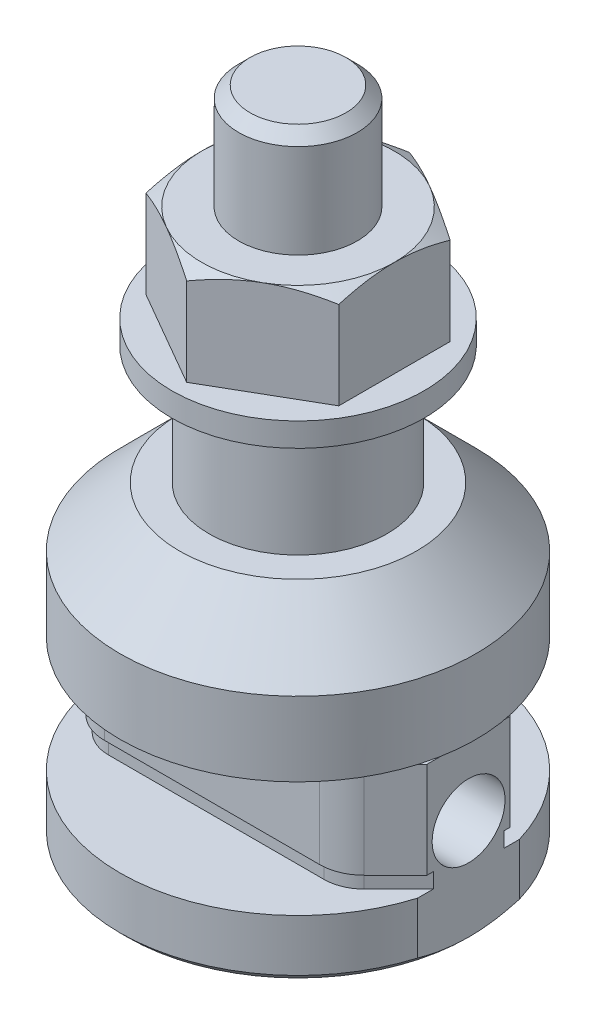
ISO-10303-21;
HEADER;
FILE_DESCRIPTION(('STEP AP214'),'2;1');
FILE_NAME('part.step','',(''),(''),'','','');
FILE_SCHEMA(('AUTOMOTIVE_DESIGN { 1 0 10303 214 1 1 1 1 }'));
ENDSEC;
DATA;
#1=APPLICATION_CONTEXT('core data for automotive mechanical design processes');
#2=APPLICATION_PROTOCOL_DEFINITION('international standard','automotive_design',2000,#1);
#3=PRODUCT_CONTEXT('',#1,'mechanical');
#4=PRODUCT('Part','Part','',(#3));
#5=PRODUCT_RELATED_PRODUCT_CATEGORY('part','',(#4));
#6=PRODUCT_DEFINITION_FORMATION('','',#4);
#7=PRODUCT_DEFINITION_CONTEXT('part definition',#1,'design');
#8=PRODUCT_DEFINITION('design','',#6,#7);
#9=PRODUCT_DEFINITION_SHAPE('','',#8);
#10=(LENGTH_UNIT() NAMED_UNIT(*) SI_UNIT(.MILLI.,.METRE.));
#11=(NAMED_UNIT(*) PLANE_ANGLE_UNIT() SI_UNIT($,.RADIAN.));
#12=(NAMED_UNIT(*) SI_UNIT($,.STERADIAN.) SOLID_ANGLE_UNIT());
#13=UNCERTAINTY_MEASURE_WITH_UNIT(LENGTH_MEASURE(1.E-05),#10,'distance_accuracy_value','');
#14=(GEOMETRIC_REPRESENTATION_CONTEXT(3) GLOBAL_UNCERTAINTY_ASSIGNED_CONTEXT((#13)) GLOBAL_UNIT_ASSIGNED_CONTEXT((#10,
#11,#12)) REPRESENTATION_CONTEXT('',''));
#15=CARTESIAN_POINT('',(0.,0.,0.));
#16=DIRECTION('',(0.,0.,1.));
#17=DIRECTION('',(1.,0.,0.));
#18=AXIS2_PLACEMENT_3D('',#15,#16,#17);
#19=CARTESIAN_POINT('',(0.,37.2,0.));
#20=DIRECTION('',(0.,-1.,0.));
#21=DIRECTION('',(0.,0.,-1.));
#22=AXIS2_PLACEMENT_3D('',#19,#20,#21);
#23=PLANE('',#22);
#24=CARTESIAN_POINT('',(0.,37.2000000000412,0.));
#25=DIRECTION('',(0.,-1.,0.));
#26=DIRECTION('',(0.,0.,-1.));
#27=AXIS2_PLACEMENT_3D('',#24,#25,#26);
#28=CIRCLE('',#27,3.23300000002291);
#29=CARTESIAN_POINT('',(0.,37.2000000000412,-3.23300000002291));
#30=VERTEX_POINT('',#29);
#31=EDGE_CURVE('E22',#30,#30,#28,.T.);
#32=ORIENTED_EDGE('',*,*,#31,.F.);
#33=EDGE_LOOP('',(#32));
#34=FACE_BOUND('',#33,.T.);
#35=ADVANCED_FACE('F19',(#34),#23,.F.);
#36=CARTESIAN_POINT('',(0.,36.433000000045,0.));
#37=DIRECTION('',(0.,-1.,0.));
#38=DIRECTION('',(0.,0.,-1.));
#39=AXIS2_PLACEMENT_3D('',#36,#37,#38);
#40=CONICAL_SURFACE('',#39,4.0000000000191,0.785398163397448);
#41=ORIENTED_EDGE('',*,*,#31,.T.);
#42=EDGE_LOOP('',(#41));
#43=FACE_BOUND('',#42,.T.);
#44=CARTESIAN_POINT('',(0.,36.433,0.));
#45=DIRECTION('',(0.,1.,0.));
#46=DIRECTION('',(0.,0.,1.));
#47=AXIS2_PLACEMENT_3D('',#44,#45,#46);
#48=CIRCLE('',#47,4.);
#49=CARTESIAN_POINT('',(0.,36.433,4.));
#50=VERTEX_POINT('',#49);
#51=EDGE_CURVE('E370',#50,#50,#48,.F.);
#52=ORIENTED_EDGE('',*,*,#51,.F.);
#53=EDGE_LOOP('',(#52));
#54=FACE_BOUND('',#53,.T.);
#55=ADVANCED_FACE('F278',(#43,#54),#40,.T.);
#56=CARTESIAN_POINT('',(0.,-6.8,0.));
#57=DIRECTION('',(0.,1.,0.));
#58=DIRECTION('',(0.,0.,1.));
#59=AXIS2_PLACEMENT_3D('',#56,#57,#58);
#60=CYLINDRICAL_SURFACE('',#59,4.);
#61=ORIENTED_EDGE('',*,*,#51,.T.);
#62=EDGE_LOOP('',(#61));
#63=FACE_BOUND('',#62,.T.);
#64=CARTESIAN_POINT('',(0.,30.1,0.));
#65=DIRECTION('',(0.,1.,0.));
#66=DIRECTION('',(0.,0.,1.));
#67=AXIS2_PLACEMENT_3D('',#64,#65,#66);
#68=CIRCLE('',#67,4.);
#69=CARTESIAN_POINT('',(0.,30.1,4.));
#70=VERTEX_POINT('',#69);
#71=EDGE_CURVE('E240',#70,#70,#68,.T.);
#72=ORIENTED_EDGE('',*,*,#71,.T.);
#73=EDGE_LOOP('',(#72));
#74=FACE_BOUND('',#73,.T.);
#75=ADVANCED_FACE('F275',(#63,#74),#60,.T.);
#76=CARTESIAN_POINT('',(0.,30.1,0.));
#77=DIRECTION('',(0.,-1.,0.));
#78=DIRECTION('',(0.,0.,-1.));
#79=AXIS2_PLACEMENT_3D('',#76,#77,#78);
#80=PLANE('',#79);
#81=ORIENTED_EDGE('',*,*,#71,.F.);
#82=EDGE_LOOP('',(#81));
#83=FACE_BOUND('',#82,.T.);
#84=CARTESIAN_POINT('',(0.,30.1000000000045,0.));
#85=DIRECTION('',(0.,-1.,0.));
#86=DIRECTION('',(1.,0.,0.));
#87=AXIS2_PLACEMENT_3D('',#84,#85,#86);
#88=CIRCLE('',#87,6.49999999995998);
#89=CARTESIAN_POINT('',(3.24999999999,30.0999999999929,-5.62916512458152));
#90=VERTEX_POINT('',#89);
#91=CARTESIAN_POINT('',(6.49999999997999,30.0999999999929,0.));
#92=VERTEX_POINT('',#91);
#93=EDGE_CURVE('E511',#90,#92,#88,.T.);
#94=ORIENTED_EDGE('',*,*,#93,.F.);
#95=CARTESIAN_POINT('',(0.,30.1000000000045,0.));
#96=DIRECTION('',(0.,-1.,0.));
#97=DIRECTION('',(1.,0.,0.));
#98=AXIS2_PLACEMENT_3D('',#95,#96,#97);
#99=CIRCLE('',#98,6.49999999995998);
#100=CARTESIAN_POINT('',(-3.24999999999,30.0999999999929,-5.62916512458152));
#101=VERTEX_POINT('',#100);
#102=EDGE_CURVE('E235',#101,#90,#99,.T.);
#103=ORIENTED_EDGE('',*,*,#102,.F.);
#104=CARTESIAN_POINT('',(0.,30.1000000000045,0.));
#105=DIRECTION('',(0.,-1.,0.));
#106=DIRECTION('',(1.,0.,0.));
#107=AXIS2_PLACEMENT_3D('',#104,#105,#106);
#108=CIRCLE('',#107,6.49999999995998);
#109=CARTESIAN_POINT('',(-6.49999999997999,30.0999999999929,0.));
#110=VERTEX_POINT('',#109);
#111=EDGE_CURVE('E232',#110,#101,#108,.T.);
#112=ORIENTED_EDGE('',*,*,#111,.F.);
#113=CARTESIAN_POINT('',(0.,30.1000000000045,0.));
#114=DIRECTION('',(0.,-1.,0.));
#115=DIRECTION('',(1.,0.,0.));
#116=AXIS2_PLACEMENT_3D('',#113,#114,#115);
#117=CIRCLE('',#116,6.49999999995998);
#118=CARTESIAN_POINT('',(-3.24999999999,30.0999999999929,5.62916512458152));
#119=VERTEX_POINT('',#118);
#120=EDGE_CURVE('E209',#119,#110,#117,.T.);
#121=ORIENTED_EDGE('',*,*,#120,.F.);
#122=CARTESIAN_POINT('',(0.,30.1000000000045,0.));
#123=DIRECTION('',(0.,-1.,0.));
#124=DIRECTION('',(1.,0.,0.));
#125=AXIS2_PLACEMENT_3D('',#122,#123,#124);
#126=CIRCLE('',#125,6.49999999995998);
#127=CARTESIAN_POINT('',(3.24999999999,30.0999999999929,5.62916512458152));
#128=VERTEX_POINT('',#127);
#129=EDGE_CURVE('E218',#128,#119,#126,.T.);
#130=ORIENTED_EDGE('',*,*,#129,.F.);
#131=CARTESIAN_POINT('',(0.,30.1000000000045,0.));
#132=DIRECTION('',(0.,-1.,0.));
#133=DIRECTION('',(1.,0.,0.));
#134=AXIS2_PLACEMENT_3D('',#131,#132,#133);
#135=CIRCLE('',#134,6.49999999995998);
#136=EDGE_CURVE('E513',#92,#128,#135,.T.);
#137=ORIENTED_EDGE('',*,*,#136,.F.);
#138=EDGE_LOOP('',(#94,#103,#112,#121,#130,#137));
#139=FACE_BOUND('',#138,.T.);
#140=ADVANCED_FACE('F234',(#83,#139),#80,.F.);
#141=CARTESIAN_POINT('',(0.,29.5159600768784,0.));
#142=DIRECTION('',(0.,-1.,0.));
#143=DIRECTION('',(1.,0.,0.));
#144=AXIS2_PLACEMENT_3D('',#141,#142,#143);
#145=CONICAL_SURFACE('',#144,7.51158682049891,1.047197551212);
#146=ORIENTED_EDGE('',*,*,#111,.T.);
#147=CARTESIAN_POINT('',(-6.50000000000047,29.5194434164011,-3.75277674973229));
#148=CARTESIAN_POINT('',(-6.23545138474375,29.6076484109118,-3.9055139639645));
#149=CARTESIAN_POINT('',(-5.9687841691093,29.6884595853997,-4.0594743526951));
#150=CARTESIAN_POINT('',(-5.43309909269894,29.8309686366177,-4.36875227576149));
#151=CARTESIAN_POINT('',(-5.16409991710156,29.8927610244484,-4.52405902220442));
#152=CARTESIAN_POINT('',(-4.75806245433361,29.9686315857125,-4.75848486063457));
#153=CARTESIAN_POINT('',(-4.62220372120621,29.9911279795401,-4.83692293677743));
#154=CARTESIAN_POINT('',(-4.34983584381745,30.0300697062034,-4.99417460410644));
#155=CARTESIAN_POINT('',(-4.21332671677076,30.0465151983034,-5.07298818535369));
#156=CARTESIAN_POINT('',(-3.93915312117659,30.0730661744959,-5.23128238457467));
#157=CARTESIAN_POINT('',(-3.80148629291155,30.083139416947,-5.31076436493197));
#158=CARTESIAN_POINT('',(-3.52588189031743,30.096620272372,-5.46988464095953));
#159=CARTESIAN_POINT('',(-3.3879442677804,30.1000265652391,-5.54952296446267));
#160=CARTESIAN_POINT('',(-3.25000000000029,30.0999999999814,-5.62916512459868));
#161=B_SPLINE_CURVE_WITH_KNOTS('',3,(#147,#148,#149,#150,#151,#152,#153,#154,#155,#156,#157,
#158,#159,#160),.UNSPECIFIED.,.F.,.F.,(4,2,2,2,2,2,4),(0.,0.954247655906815,1.90367376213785,
2.37900973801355,2.85433320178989,3.33204281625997,3.80984701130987),.UNSPECIFIED.);
#162=CARTESIAN_POINT('',(-6.5,29.5194434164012,-3.75277674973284));
#163=VERTEX_POINT('',#162);
#164=EDGE_CURVE('E243',#163,#101,#161,.T.);
#165=ORIENTED_EDGE('',*,*,#164,.F.);
#166=CARTESIAN_POINT('',(-6.49999999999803,30.0999999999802,0.));
#167=CARTESIAN_POINT('',(-6.49999999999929,30.1000265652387,-0.159284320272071));
#168=CARTESIAN_POINT('',(-6.49999999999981,30.0966202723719,-0.318560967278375));
#169=CARTESIAN_POINT('',(-6.50000000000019,30.0831394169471,-0.636801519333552));
#170=CARTESIAN_POINT('',(-6.50000000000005,30.0730661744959,-0.795765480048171));
#171=CARTESIAN_POINT('',(-6.49999999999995,30.0465151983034,-1.11235387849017));
#172=CARTESIAN_POINT('',(-6.49999999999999,30.0300697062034,-1.26998104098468));
#173=CARTESIAN_POINT('',(-6.50000000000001,29.9911279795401,-1.58448437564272));
#174=CARTESIAN_POINT('',(-6.50000000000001,29.9686315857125,-1.74136052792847));
#175=CARTESIAN_POINT('',(-6.49999999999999,29.8927610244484,-2.21021220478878));
#176=CARTESIAN_POINT('',(-6.5,29.8309686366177,-2.52082569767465));
#177=CARTESIAN_POINT('',(-6.50000000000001,29.6884595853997,-3.13938154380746));
#178=CARTESIAN_POINT('',(-6.50000000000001,29.6076484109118,-3.44730232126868));
#179=CARTESIAN_POINT('',(-6.5,29.5194434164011,-3.75277674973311));
#180=B_SPLINE_CURVE_WITH_KNOTS('',3,(#166,#167,#168,#169,#170,#171,#172,#173,#174,#175,#176,
#177,#178,#179),.UNSPECIFIED.,.F.,.F.,(4,2,2,2,2,2,4),(0.,0.477804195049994,0.955513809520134,
1.43083727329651,1.90617324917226,2.85559935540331,3.80984701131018),.UNSPECIFIED.);
#181=EDGE_CURVE('E225',#110,#163,#180,.T.);
#182=ORIENTED_EDGE('',*,*,#181,.F.);
#183=EDGE_LOOP('',(#146,#165,#182));
#184=FACE_BOUND('',#183,.T.);
#185=ADVANCED_FACE('F242',(#184),#145,.T.);
#186=CARTESIAN_POINT('',(0.,29.5159600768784,0.));
#187=DIRECTION('',(0.,-1.,0.));
#188=DIRECTION('',(1.,0.,0.));
#189=AXIS2_PLACEMENT_3D('',#186,#187,#188);
#190=CONICAL_SURFACE('',#189,7.51158682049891,1.047197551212);
#191=ORIENTED_EDGE('',*,*,#102,.T.);
#192=CARTESIAN_POINT('',(-4.67222282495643E-13,29.5194434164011,-7.50555349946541));
#193=CARTESIAN_POINT('',(0.264548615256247,29.6076484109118,-7.3528162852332));
#194=CARTESIAN_POINT('',(0.531215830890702,29.6884595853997,-7.1988558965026));
#195=CARTESIAN_POINT('',(1.06690090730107,29.8309686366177,-6.88957797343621));
#196=CARTESIAN_POINT('',(1.33590008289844,29.8927610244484,-6.73427122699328));
#197=CARTESIAN_POINT('',(1.74193754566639,29.9686315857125,-6.49984538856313));
#198=CARTESIAN_POINT('',(1.87779627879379,29.9911279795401,-6.42140731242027));
#199=CARTESIAN_POINT('',(2.15016415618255,30.0300697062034,-6.26415564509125));
#200=CARTESIAN_POINT('',(2.28667328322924,30.0465151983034,-6.18534206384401));
#201=CARTESIAN_POINT('',(2.56084687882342,30.0730661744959,-6.02704786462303));
#202=CARTESIAN_POINT('',(2.69851370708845,30.083139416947,-5.94756588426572));
#203=CARTESIAN_POINT('',(2.97411810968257,30.096620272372,-5.78844560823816));
#204=CARTESIAN_POINT('',(3.11205573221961,30.1000265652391,-5.70880728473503));
#205=CARTESIAN_POINT('',(3.24999999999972,30.0999999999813,-5.62916512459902));
#206=B_SPLINE_CURVE_WITH_KNOTS('',3,(#192,#193,#194,#195,#196,#197,#198,#199,#200,#201,#202,
#203,#204,#205),.UNSPECIFIED.,.F.,.F.,(4,2,2,2,2,2,4),(0.,0.954247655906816,1.90367376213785,
2.37900973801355,2.8543332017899,3.33204281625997,3.80984701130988),.UNSPECIFIED.);
#207=CARTESIAN_POINT('',(2.36243815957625E-13,29.5194434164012,-7.50555349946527));
#208=VERTEX_POINT('',#207);
#209=EDGE_CURVE('E539',#208,#90,#206,.T.);
#210=ORIENTED_EDGE('',*,*,#209,.F.);
#211=CARTESIAN_POINT('',(-3.24999999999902,30.0999999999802,-5.62916512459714));
#212=CARTESIAN_POINT('',(-3.1120557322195,30.1000265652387,-5.70880728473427));
#213=CARTESIAN_POINT('',(-2.97411810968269,30.0966202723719,-5.78844560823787));
#214=CARTESIAN_POINT('',(-2.69851370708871,30.0831394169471,-5.94756588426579));
#215=CARTESIAN_POINT('',(-2.56084687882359,30.073066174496,-6.02704786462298));
#216=CARTESIAN_POINT('',(-2.28667328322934,30.0465151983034,-6.18534206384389));
#217=CARTESIAN_POINT('',(-2.15016415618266,30.0300697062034,-6.26415564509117));
#218=CARTESIAN_POINT('',(-1.87779627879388,29.9911279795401,-6.42140731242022));
#219=CARTESIAN_POINT('',(-1.74193754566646,29.9686315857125,-6.49984538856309));
#220=CARTESIAN_POINT('',(-1.33590008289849,29.8927610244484,-6.73427122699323));
#221=CARTESIAN_POINT('',(-1.06690090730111,29.8309686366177,-6.88957797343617));
#222=CARTESIAN_POINT('',(-0.531215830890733,29.6884595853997,-7.19885589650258));
#223=CARTESIAN_POINT('',(-0.264548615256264,29.6076484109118,-7.35281628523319));
#224=CARTESIAN_POINT('',(4.70571360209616E-13,29.5194434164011,-7.5055534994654));
#225=B_SPLINE_CURVE_WITH_KNOTS('',3,(#211,#212,#213,#214,#215,#216,#217,#218,#219,#220,#221,
#222,#223,#224),.UNSPECIFIED.,.F.,.F.,(4,2,2,2,2,2,4),(0.,0.477804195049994,0.955513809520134,
1.43083727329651,1.90617324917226,2.85559935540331,3.80984701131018),.UNSPECIFIED.);
#226=EDGE_CURVE('E245',#101,#208,#225,.T.);
#227=ORIENTED_EDGE('',*,*,#226,.F.);
#228=EDGE_LOOP('',(#191,#210,#227));
#229=FACE_BOUND('',#228,.T.);
#230=ADVANCED_FACE('F269',(#229),#190,.T.);
#231=CARTESIAN_POINT('',(0.,29.5159600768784,0.));
#232=DIRECTION('',(0.,-1.,0.));
#233=DIRECTION('',(1.,0.,0.));
#234=AXIS2_PLACEMENT_3D('',#231,#232,#233);
#235=CONICAL_SURFACE('',#234,7.51158682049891,1.047197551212);
#236=ORIENTED_EDGE('',*,*,#93,.T.);
#237=CARTESIAN_POINT('',(6.5,29.5194434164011,-3.75277674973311));
#238=CARTESIAN_POINT('',(6.5,29.6076484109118,-3.4473023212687));
#239=CARTESIAN_POINT('',(6.5,29.6884595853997,-3.1393815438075));
#240=CARTESIAN_POINT('',(6.5,29.8309686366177,-2.52082569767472));
#241=CARTESIAN_POINT('',(6.5,29.8927610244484,-2.21021220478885));
#242=CARTESIAN_POINT('',(6.5,29.9686315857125,-1.74136052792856));
#243=CARTESIAN_POINT('',(6.5,29.9911279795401,-1.58448437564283));
#244=CARTESIAN_POINT('',(6.5,30.0300697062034,-1.26998104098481));
#245=CARTESIAN_POINT('',(6.5,30.0465151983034,-1.11235387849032));
#246=CARTESIAN_POINT('',(6.5,30.0730661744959,-0.795765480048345));
#247=CARTESIAN_POINT('',(6.5,30.083139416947,-0.636801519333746));
#248=CARTESIAN_POINT('',(6.5,30.096620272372,-0.318560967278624));
#249=CARTESIAN_POINT('',(6.5,30.1000265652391,-0.159284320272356));
#250=CARTESIAN_POINT('',(6.5,30.0999999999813,-3.2956283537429E-13));
#251=B_SPLINE_CURVE_WITH_KNOTS('',3,(#237,#238,#239,#240,#241,#242,#243,#244,#245,#246,#247,
#248,#249,#250),.UNSPECIFIED.,.F.,.F.,(4,2,2,2,2,2,4),(0.,0.954247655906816,1.90367376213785,
2.37900973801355,2.8543332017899,3.33204281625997,3.80984701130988),.UNSPECIFIED.);
#252=CARTESIAN_POINT('',(6.50000000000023,29.5194434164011,-3.75277674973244));
#253=VERTEX_POINT('',#252);
#254=EDGE_CURVE('E484',#253,#92,#251,.T.);
#255=ORIENTED_EDGE('',*,*,#254,.F.);
#256=CARTESIAN_POINT('',(3.24999999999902,30.0999999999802,-5.62916512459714));
#257=CARTESIAN_POINT('',(3.3879442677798,30.1000265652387,-5.5495229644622));
#258=CARTESIAN_POINT('',(3.52588189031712,30.0966202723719,-5.4698846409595));
#259=CARTESIAN_POINT('',(3.80148629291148,30.0831394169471,-5.31076436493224));
#260=CARTESIAN_POINT('',(3.93915312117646,30.0730661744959,-5.23128238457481));
#261=CARTESIAN_POINT('',(4.21332671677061,30.0465151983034,-5.07298818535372));
#262=CARTESIAN_POINT('',(4.34983584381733,30.0300697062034,-4.9941746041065));
#263=CARTESIAN_POINT('',(4.62220372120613,29.9911279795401,-4.8369229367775));
#264=CARTESIAN_POINT('',(4.75806245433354,29.9686315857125,-4.75848486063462));
#265=CARTESIAN_POINT('',(5.1640999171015,29.8927610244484,-4.52405902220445));
#266=CARTESIAN_POINT('',(5.43309909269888,29.8309686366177,-4.36875227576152));
#267=CARTESIAN_POINT('',(5.96878416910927,29.6884595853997,-4.05947435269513));
#268=CARTESIAN_POINT('',(6.23545138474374,29.6076484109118,-3.90551396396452));
#269=CARTESIAN_POINT('',(6.50000000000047,29.5194434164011,-3.7527767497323));
#270=B_SPLINE_CURVE_WITH_KNOTS('',3,(#256,#257,#258,#259,#260,#261,#262,#263,#264,#265,#266,
#267,#268,#269),.UNSPECIFIED.,.F.,.F.,(4,2,2,2,2,2,4),(0.,0.477804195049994,0.955513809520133,
1.43083727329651,1.90617324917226,2.8555993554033,3.80984701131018),.UNSPECIFIED.);
#271=EDGE_CURVE('E492',#90,#253,#270,.T.);
#272=ORIENTED_EDGE('',*,*,#271,.F.);
#273=EDGE_LOOP('',(#236,#255,#272));
#274=FACE_BOUND('',#273,.T.);
#275=ADVANCED_FACE('F498',(#274),#235,.T.);
#276=CARTESIAN_POINT('',(0.,29.5159600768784,0.));
#277=DIRECTION('',(0.,-1.,0.));
#278=DIRECTION('',(1.,0.,0.));
#279=AXIS2_PLACEMENT_3D('',#276,#277,#278);
#280=CONICAL_SURFACE('',#279,7.51158682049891,1.047197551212);
#281=ORIENTED_EDGE('',*,*,#136,.T.);
#282=CARTESIAN_POINT('',(6.50000000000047,29.5194434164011,3.75277674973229));
#283=CARTESIAN_POINT('',(6.23545138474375,29.6076484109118,3.9055139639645));
#284=CARTESIAN_POINT('',(5.9687841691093,29.6884595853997,4.0594743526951));
#285=CARTESIAN_POINT('',(5.43309909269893,29.8309686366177,4.36875227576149));
#286=CARTESIAN_POINT('',(5.16409991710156,29.8927610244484,4.52405902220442));
#287=CARTESIAN_POINT('',(4.75806245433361,29.9686315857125,4.75848486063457));
#288=CARTESIAN_POINT('',(4.62220372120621,29.9911279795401,4.83692293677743));
#289=CARTESIAN_POINT('',(4.34983584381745,30.0300697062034,4.99417460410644));
#290=CARTESIAN_POINT('',(4.21332671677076,30.0465151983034,5.07298818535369));
#291=CARTESIAN_POINT('',(3.93915312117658,30.0730661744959,5.23128238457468));
#292=CARTESIAN_POINT('',(3.80148629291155,30.083139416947,5.31076436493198));
#293=CARTESIAN_POINT('',(3.52588189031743,30.096620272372,5.46988464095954));
#294=CARTESIAN_POINT('',(3.3879442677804,30.1000265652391,5.54952296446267));
#295=CARTESIAN_POINT('',(3.25000000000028,30.0999999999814,5.62916512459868));
#296=B_SPLINE_CURVE_WITH_KNOTS('',3,(#282,#283,#284,#285,#286,#287,#288,#289,#290,#291,#292,
#293,#294,#295),.UNSPECIFIED.,.F.,.F.,(4,2,2,2,2,2,4),(0.,0.954247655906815,1.90367376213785,
2.37900973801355,2.85433320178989,3.33204281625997,3.80984701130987),.UNSPECIFIED.);
#297=CARTESIAN_POINT('',(6.5,29.5194434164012,3.75277674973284));
#298=VERTEX_POINT('',#297);
#299=EDGE_CURVE('E458',#298,#128,#296,.T.);
#300=ORIENTED_EDGE('',*,*,#299,.F.);
#301=CARTESIAN_POINT('',(6.49999999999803,30.0999999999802,0.));
#302=CARTESIAN_POINT('',(6.49999999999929,30.1000265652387,0.159284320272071));
#303=CARTESIAN_POINT('',(6.49999999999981,30.0966202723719,0.318560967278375));
#304=CARTESIAN_POINT('',(6.50000000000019,30.0831394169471,0.636801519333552));
#305=CARTESIAN_POINT('',(6.50000000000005,30.0730661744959,0.795765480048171));
#306=CARTESIAN_POINT('',(6.49999999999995,30.0465151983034,1.11235387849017));
#307=CARTESIAN_POINT('',(6.49999999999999,30.0300697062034,1.26998104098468));
#308=CARTESIAN_POINT('',(6.50000000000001,29.9911279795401,1.58448437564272));
#309=CARTESIAN_POINT('',(6.50000000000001,29.9686315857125,1.74136052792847));
#310=CARTESIAN_POINT('',(6.49999999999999,29.8927610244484,2.21021220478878));
#311=CARTESIAN_POINT('',(6.5,29.8309686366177,2.52082569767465));
#312=CARTESIAN_POINT('',(6.50000000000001,29.6884595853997,3.13938154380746));
#313=CARTESIAN_POINT('',(6.50000000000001,29.6076484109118,3.44730232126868));
#314=CARTESIAN_POINT('',(6.5,29.5194434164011,3.75277674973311));
#315=B_SPLINE_CURVE_WITH_KNOTS('',3,(#301,#302,#303,#304,#305,#306,#307,#308,#309,#310,#311,
#312,#313,#314),.UNSPECIFIED.,.F.,.F.,(4,2,2,2,2,2,4),(0.,0.477804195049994,0.955513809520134,
1.43083727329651,1.90617324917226,2.85559935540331,3.80984701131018),.UNSPECIFIED.);
#316=EDGE_CURVE('E478',#92,#298,#315,.T.);
#317=ORIENTED_EDGE('',*,*,#316,.F.);
#318=EDGE_LOOP('',(#281,#300,#317));
#319=FACE_BOUND('',#318,.T.);
#320=ADVANCED_FACE('F447',(#319),#280,.T.);
#321=CARTESIAN_POINT('',(0.,29.5159600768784,0.));
#322=DIRECTION('',(0.,-1.,0.));
#323=DIRECTION('',(1.,0.,0.));
#324=AXIS2_PLACEMENT_3D('',#321,#322,#323);
#325=CONICAL_SURFACE('',#324,7.51158682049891,1.047197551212);
#326=ORIENTED_EDGE('',*,*,#129,.T.);
#327=CARTESIAN_POINT('',(4.667888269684E-13,29.5194434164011,7.50555349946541));
#328=CARTESIAN_POINT('',(-0.264548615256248,29.6076484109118,7.3528162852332));
#329=CARTESIAN_POINT('',(-0.531215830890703,29.6884595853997,7.1988558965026));
#330=CARTESIAN_POINT('',(-1.06690090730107,29.8309686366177,6.88957797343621));
#331=CARTESIAN_POINT('',(-1.33590008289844,29.8927610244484,6.73427122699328));
#332=CARTESIAN_POINT('',(-1.74193754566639,29.9686315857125,6.49984538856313));
#333=CARTESIAN_POINT('',(-1.87779627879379,29.9911279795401,6.42140731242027));
#334=CARTESIAN_POINT('',(-2.15016415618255,30.0300697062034,6.26415564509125));
#335=CARTESIAN_POINT('',(-2.28667328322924,30.0465151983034,6.18534206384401));
#336=CARTESIAN_POINT('',(-2.56084687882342,30.0730661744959,6.02704786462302));
#337=CARTESIAN_POINT('',(-2.69851370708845,30.083139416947,5.94756588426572));
#338=CARTESIAN_POINT('',(-2.97411810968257,30.096620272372,5.78844560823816));
#339=CARTESIAN_POINT('',(-3.11205573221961,30.1000265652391,5.70880728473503));
#340=CARTESIAN_POINT('',(-3.24999999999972,30.0999999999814,5.62916512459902));
#341=B_SPLINE_CURVE_WITH_KNOTS('',3,(#327,#328,#329,#330,#331,#332,#333,#334,#335,#336,#337,
#338,#339,#340),.UNSPECIFIED.,.F.,.F.,(4,2,2,2,2,2,4),(0.,0.954247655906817,1.90367376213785,
2.37900973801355,2.8543332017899,3.33204281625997,3.80984701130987),.UNSPECIFIED.);
#342=CARTESIAN_POINT('',(-2.36595212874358E-13,29.5194434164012,7.50555349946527));
#343=VERTEX_POINT('',#342);
#344=EDGE_CURVE('E429',#343,#119,#341,.T.);
#345=ORIENTED_EDGE('',*,*,#344,.F.);
#346=CARTESIAN_POINT('',(3.24999999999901,30.0999999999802,5.62916512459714));
#347=CARTESIAN_POINT('',(3.11205573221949,30.1000265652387,5.70880728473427));
#348=CARTESIAN_POINT('',(2.97411810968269,30.0966202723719,5.78844560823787));
#349=CARTESIAN_POINT('',(2.69851370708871,30.0831394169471,5.94756588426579));
#350=CARTESIAN_POINT('',(2.56084687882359,30.0730661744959,6.02704786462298));
#351=CARTESIAN_POINT('',(2.28667328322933,30.0465151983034,6.18534206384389));
#352=CARTESIAN_POINT('',(2.15016415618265,30.0300697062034,6.26415564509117));
#353=CARTESIAN_POINT('',(1.87779627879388,29.9911279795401,6.42140731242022));
#354=CARTESIAN_POINT('',(1.74193754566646,29.9686315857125,6.49984538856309));
#355=CARTESIAN_POINT('',(1.33590008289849,29.8927610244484,6.73427122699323));
#356=CARTESIAN_POINT('',(1.06690090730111,29.8309686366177,6.88957797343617));
#357=CARTESIAN_POINT('',(0.531215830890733,29.6884595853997,7.19885589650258));
#358=CARTESIAN_POINT('',(0.264548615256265,29.6076484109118,7.35281628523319));
#359=CARTESIAN_POINT('',(-4.70707263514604E-13,29.5194434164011,7.5055534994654));
#360=B_SPLINE_CURVE_WITH_KNOTS('',3,(#346,#347,#348,#349,#350,#351,#352,#353,#354,#355,#356,
#357,#358,#359),.UNSPECIFIED.,.F.,.F.,(4,2,2,2,2,2,4),(0.,0.477804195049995,0.955513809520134,
1.43083727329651,1.90617324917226,2.85559935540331,3.80984701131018),.UNSPECIFIED.);
#361=EDGE_CURVE('E451',#128,#343,#360,.T.);
#362=ORIENTED_EDGE('',*,*,#361,.F.);
#363=EDGE_LOOP('',(#326,#345,#362));
#364=FACE_BOUND('',#363,.T.);
#365=ADVANCED_FACE('F442',(#364),#325,.T.);
#366=CARTESIAN_POINT('',(0.,29.5159600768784,0.));
#367=DIRECTION('',(0.,-1.,0.));
#368=DIRECTION('',(1.,0.,0.));
#369=AXIS2_PLACEMENT_3D('',#366,#367,#368);
#370=CONICAL_SURFACE('',#369,7.51158682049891,1.047197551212);
#371=CARTESIAN_POINT('',(-3.24999999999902,30.0999999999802,5.62916512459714));
#372=CARTESIAN_POINT('',(-3.3879442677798,30.1000265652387,5.5495229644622));
#373=CARTESIAN_POINT('',(-3.52588189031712,30.0966202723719,5.4698846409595));
#374=CARTESIAN_POINT('',(-3.80148629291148,30.0831394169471,5.31076436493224));
#375=CARTESIAN_POINT('',(-3.93915312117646,30.0730661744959,5.23128238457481));
#376=CARTESIAN_POINT('',(-4.21332671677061,30.0465151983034,5.07298818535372));
#377=CARTESIAN_POINT('',(-4.34983584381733,30.0300697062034,4.9941746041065));
#378=CARTESIAN_POINT('',(-4.62220372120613,29.9911279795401,4.8369229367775));
#379=CARTESIAN_POINT('',(-4.75806245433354,29.9686315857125,4.75848486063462));
#380=CARTESIAN_POINT('',(-5.1640999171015,29.8927610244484,4.52405902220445));
#381=CARTESIAN_POINT('',(-5.43309909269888,29.8309686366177,4.36875227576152));
#382=CARTESIAN_POINT('',(-5.96878416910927,29.6884595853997,4.05947435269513));
#383=CARTESIAN_POINT('',(-6.23545138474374,29.6076484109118,3.90551396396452));
#384=CARTESIAN_POINT('',(-6.50000000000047,29.5194434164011,3.7527767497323));
#385=B_SPLINE_CURVE_WITH_KNOTS('',3,(#371,#372,#373,#374,#375,#376,#377,#378,#379,#380,#381,
#382,#383,#384),.UNSPECIFIED.,.F.,.F.,(4,2,2,2,2,2,4),(0.,0.477804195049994,0.955513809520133,
1.43083727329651,1.90617324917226,2.85559935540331,3.80984701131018),.UNSPECIFIED.);
#386=CARTESIAN_POINT('',(-6.50000000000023,29.5194434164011,3.75277674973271));
#387=VERTEX_POINT('',#386);
#388=EDGE_CURVE('E214',#119,#387,#385,.T.);
#389=ORIENTED_EDGE('',*,*,#388,.F.);
#390=ORIENTED_EDGE('',*,*,#120,.T.);
#391=CARTESIAN_POINT('',(-6.5,29.5194434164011,3.75277674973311));
#392=CARTESIAN_POINT('',(-6.5,29.6076484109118,3.4473023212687));
#393=CARTESIAN_POINT('',(-6.5,29.6884595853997,3.1393815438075));
#394=CARTESIAN_POINT('',(-6.5,29.8309686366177,2.52082569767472));
#395=CARTESIAN_POINT('',(-6.5,29.8927610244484,2.21021220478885));
#396=CARTESIAN_POINT('',(-6.5,29.9686315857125,1.74136052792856));
#397=CARTESIAN_POINT('',(-6.5,29.9911279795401,1.58448437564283));
#398=CARTESIAN_POINT('',(-6.5,30.0300697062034,1.26998104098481));
#399=CARTESIAN_POINT('',(-6.5,30.0465151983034,1.11235387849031));
#400=CARTESIAN_POINT('',(-6.5,30.0730661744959,0.795765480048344));
#401=CARTESIAN_POINT('',(-6.5,30.083139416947,0.636801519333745));
#402=CARTESIAN_POINT('',(-6.5,30.096620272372,0.318560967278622));
#403=CARTESIAN_POINT('',(-6.5,30.1000265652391,0.159284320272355));
#404=CARTESIAN_POINT('',(-6.5,30.0999999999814,3.28397529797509E-13));
#405=B_SPLINE_CURVE_WITH_KNOTS('',3,(#391,#392,#393,#394,#395,#396,#397,#398,#399,#400,#401,
#402,#403,#404),.UNSPECIFIED.,.F.,.F.,(4,2,2,2,2,2,4),(0.,0.954247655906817,1.90367376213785,
2.37900973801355,2.8543332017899,3.33204281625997,3.80984701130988),.UNSPECIFIED.);
#406=EDGE_CURVE('E212',#387,#110,#405,.T.);
#407=ORIENTED_EDGE('',*,*,#406,.F.);
#408=EDGE_LOOP('',(#389,#390,#407));
#409=FACE_BOUND('',#408,.T.);
#410=ADVANCED_FACE('F211',(#409),#370,.T.);
#411=CARTESIAN_POINT('',(-6.5,23.6,-3.75277674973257));
#412=DIRECTION('',(-1.,0.,0.));
#413=DIRECTION('',(0.,0.,1.));
#414=AXIS2_PLACEMENT_3D('',#411,#412,#413);
#415=PLANE('',#414);
#416=DIRECTION('',(0.,0.,1.));
#417=VECTOR('',#416,1.);
#418=CARTESIAN_POINT('',(-6.5,23.6,0.));
#419=LINE('',#418,#417);
#420=CARTESIAN_POINT('',(-6.5,23.6,3.75277674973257));
#421=VERTEX_POINT('',#420);
#422=CARTESIAN_POINT('',(-6.5,23.6,-3.75277674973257));
#423=VERTEX_POINT('',#422);
#424=EDGE_CURVE('E399',#421,#423,#419,.F.);
#425=ORIENTED_EDGE('',*,*,#424,.F.);
#426=DIRECTION('',(0.,1.,0.));
#427=VECTOR('',#426,1.);
#428=CARTESIAN_POINT('',(-6.5,23.6,3.75277674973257));
#429=LINE('',#428,#427);
#430=EDGE_CURVE('E228',#387,#421,#429,.F.);
#431=ORIENTED_EDGE('',*,*,#430,.F.);
#432=ORIENTED_EDGE('',*,*,#406,.T.);
#433=ORIENTED_EDGE('',*,*,#181,.T.);
#434=DIRECTION('',(0.,1.,0.));
#435=VECTOR('',#434,1.);
#436=CARTESIAN_POINT('',(-6.5,23.6,-3.75277674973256));
#437=LINE('',#436,#435);
#438=EDGE_CURVE('E537',#423,#163,#437,.T.);
#439=ORIENTED_EDGE('',*,*,#438,.F.);
#440=EDGE_LOOP('',(#425,#431,#432,#433,#439));
#441=FACE_BOUND('',#440,.T.);
#442=ADVANCED_FACE('F222',(#441),#415,.T.);
#443=CARTESIAN_POINT('',(0.,23.6,-7.50555349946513));
#444=DIRECTION('',(-0.5,0.,-0.866025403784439));
#445=DIRECTION('',(-0.866025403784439,0.,0.5));
#446=AXIS2_PLACEMENT_3D('',#443,#444,#445);
#447=PLANE('',#446);
#448=DIRECTION('',(0.866025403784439,0.,-0.499999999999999));
#449=VECTOR('',#448,1.);
#450=CARTESIAN_POINT('',(-6.5,23.6,-3.75277674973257));
#451=LINE('',#450,#449);
#452=CARTESIAN_POINT('',(0.,23.6,-7.50555349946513));
#453=VERTEX_POINT('',#452);
#454=EDGE_CURVE('E375',#423,#453,#451,.T.);
#455=ORIENTED_EDGE('',*,*,#454,.F.);
#456=ORIENTED_EDGE('',*,*,#438,.T.);
#457=ORIENTED_EDGE('',*,*,#164,.T.);
#458=ORIENTED_EDGE('',*,*,#226,.T.);
#459=DIRECTION('',(0.,1.,0.));
#460=VECTOR('',#459,1.);
#461=CARTESIAN_POINT('',(0.,23.6,-7.50555349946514));
#462=LINE('',#461,#460);
#463=EDGE_CURVE('E491',#453,#208,#462,.T.);
#464=ORIENTED_EDGE('',*,*,#463,.F.);
#465=EDGE_LOOP('',(#455,#456,#457,#458,#464));
#466=FACE_BOUND('',#465,.T.);
#467=ADVANCED_FACE('F562',(#466),#447,.T.);
#468=CARTESIAN_POINT('',(6.5,23.6,-3.75277674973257));
#469=DIRECTION('',(0.5,0.,-0.866025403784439));
#470=DIRECTION('',(-0.866025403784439,0.,-0.5));
#471=AXIS2_PLACEMENT_3D('',#468,#469,#470);
#472=PLANE('',#471);
#473=DIRECTION('',(0.866025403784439,0.,0.499999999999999));
#474=VECTOR('',#473,1.);
#475=CARTESIAN_POINT('',(0.,23.6,-7.50555349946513));
#476=LINE('',#475,#474);
#477=CARTESIAN_POINT('',(6.5,23.6,-3.75277674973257));
#478=VERTEX_POINT('',#477);
#479=EDGE_CURVE('E387',#453,#478,#476,.T.);
#480=ORIENTED_EDGE('',*,*,#479,.F.);
#481=ORIENTED_EDGE('',*,*,#463,.T.);
#482=ORIENTED_EDGE('',*,*,#209,.T.);
#483=ORIENTED_EDGE('',*,*,#271,.T.);
#484=DIRECTION('',(0.,1.,0.));
#485=VECTOR('',#484,1.);
#486=CARTESIAN_POINT('',(6.5,23.6,-3.75277674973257));
#487=LINE('',#486,#485);
#488=EDGE_CURVE('E521',#478,#253,#487,.T.);
#489=ORIENTED_EDGE('',*,*,#488,.F.);
#490=EDGE_LOOP('',(#480,#481,#482,#483,#489));
#491=FACE_BOUND('',#490,.T.);
#492=ADVANCED_FACE('F474',(#491),#472,.T.);
#493=CARTESIAN_POINT('',(6.5,23.6,3.75277674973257));
#494=DIRECTION('',(1.,0.,0.));
#495=DIRECTION('',(0.,0.,-1.));
#496=AXIS2_PLACEMENT_3D('',#493,#494,#495);
#497=PLANE('',#496);
#498=DIRECTION('',(0.,0.,1.));
#499=VECTOR('',#498,1.);
#500=CARTESIAN_POINT('',(6.5,23.6,0.));
#501=LINE('',#500,#499);
#502=CARTESIAN_POINT('',(6.5,23.6,3.75277674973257));
#503=VERTEX_POINT('',#502);
#504=EDGE_CURVE('E390',#478,#503,#501,.T.);
#505=ORIENTED_EDGE('',*,*,#504,.F.);
#506=ORIENTED_EDGE('',*,*,#488,.T.);
#507=ORIENTED_EDGE('',*,*,#254,.T.);
#508=ORIENTED_EDGE('',*,*,#316,.T.);
#509=DIRECTION('',(0.,1.,0.));
#510=VECTOR('',#509,1.);
#511=CARTESIAN_POINT('',(6.5,23.6,3.75277674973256));
#512=LINE('',#511,#510);
#513=EDGE_CURVE('E457',#503,#298,#512,.T.);
#514=ORIENTED_EDGE('',*,*,#513,.F.);
#515=EDGE_LOOP('',(#505,#506,#507,#508,#514));
#516=FACE_BOUND('',#515,.T.);
#517=ADVANCED_FACE('F468',(#516),#497,.T.);
#518=CARTESIAN_POINT('',(0.,23.6,7.50555349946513));
#519=DIRECTION('',(0.5,0.,0.866025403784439));
#520=DIRECTION('',(0.866025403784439,0.,-0.5));
#521=AXIS2_PLACEMENT_3D('',#518,#519,#520);
#522=PLANE('',#521);
#523=DIRECTION('',(-0.866025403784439,0.,0.499999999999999));
#524=VECTOR('',#523,1.);
#525=CARTESIAN_POINT('',(6.5,23.6,3.75277674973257));
#526=LINE('',#525,#524);
#527=CARTESIAN_POINT('',(0.,23.6,7.50555349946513));
#528=VERTEX_POINT('',#527);
#529=EDGE_CURVE('E396',#503,#528,#526,.T.);
#530=ORIENTED_EDGE('',*,*,#529,.F.);
#531=ORIENTED_EDGE('',*,*,#513,.T.);
#532=ORIENTED_EDGE('',*,*,#299,.T.);
#533=ORIENTED_EDGE('',*,*,#361,.T.);
#534=DIRECTION('',(0.,1.,0.));
#535=VECTOR('',#534,1.);
#536=CARTESIAN_POINT('',(0.,23.6,7.50555349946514));
#537=LINE('',#536,#535);
#538=EDGE_CURVE('E402',#528,#343,#537,.T.);
#539=ORIENTED_EDGE('',*,*,#538,.F.);
#540=EDGE_LOOP('',(#530,#531,#532,#533,#539));
#541=FACE_BOUND('',#540,.T.);
#542=ADVANCED_FACE('F464',(#541),#522,.T.);
#543=CARTESIAN_POINT('',(-6.5,23.6,3.75277674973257));
#544=DIRECTION('',(-0.5,0.,0.866025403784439));
#545=DIRECTION('',(0.866025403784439,0.,0.5));
#546=AXIS2_PLACEMENT_3D('',#543,#544,#545);
#547=PLANE('',#546);
#548=DIRECTION('',(-0.866025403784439,0.,-0.499999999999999));
#549=VECTOR('',#548,1.);
#550=CARTESIAN_POINT('',(0.,23.6,7.50555349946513));
#551=LINE('',#550,#549);
#552=EDGE_CURVE('E405',#528,#421,#551,.T.);
#553=ORIENTED_EDGE('',*,*,#552,.F.);
#554=ORIENTED_EDGE('',*,*,#538,.T.);
#555=ORIENTED_EDGE('',*,*,#344,.T.);
#556=ORIENTED_EDGE('',*,*,#388,.T.);
#557=ORIENTED_EDGE('',*,*,#430,.T.);
#558=EDGE_LOOP('',(#553,#554,#555,#556,#557));
#559=FACE_BOUND('',#558,.T.);
#560=ADVANCED_FACE('F436',(#559),#547,.T.);
#561=CARTESIAN_POINT('',(0.,23.6,0.));
#562=DIRECTION('',(0.,1.,0.));
#563=DIRECTION('',(0.,0.,1.));
#564=AXIS2_PLACEMENT_3D('',#561,#562,#563);
#565=PLANE('',#564);
#566=CARTESIAN_POINT('',(0.,23.6,0.));
#567=DIRECTION('',(0.,1.,0.));
#568=DIRECTION('',(0.,0.,1.));
#569=AXIS2_PLACEMENT_3D('',#566,#567,#568);
#570=CIRCLE('',#569,8.5);
#571=CARTESIAN_POINT('',(0.,23.6,8.5));
#572=VERTEX_POINT('',#571);
#573=EDGE_CURVE('E420',#572,#572,#570,.F.);
#574=ORIENTED_EDGE('',*,*,#573,.F.);
#575=EDGE_LOOP('',(#574));
#576=FACE_BOUND('',#575,.T.);
#577=ORIENTED_EDGE('',*,*,#529,.T.);
#578=ORIENTED_EDGE('',*,*,#552,.T.);
#579=ORIENTED_EDGE('',*,*,#424,.T.);
#580=ORIENTED_EDGE('',*,*,#454,.T.);
#581=ORIENTED_EDGE('',*,*,#479,.T.);
#582=ORIENTED_EDGE('',*,*,#504,.T.);
#583=EDGE_LOOP('',(#577,#578,#579,#580,#581,#582));
#584=FACE_BOUND('',#583,.T.);
#585=ADVANCED_FACE('F551',(#576,#584),#565,.T.);
#586=CARTESIAN_POINT('',(0.,22.,0.));
#587=DIRECTION('',(0.,1.,0.));
#588=DIRECTION('',(0.,0.,1.));
#589=AXIS2_PLACEMENT_3D('',#586,#587,#588);
#590=CYLINDRICAL_SURFACE('',#589,8.5);
#591=ORIENTED_EDGE('',*,*,#573,.T.);
#592=EDGE_LOOP('',(#591));
#593=FACE_BOUND('',#592,.T.);
#594=CARTESIAN_POINT('',(0.,22.,0.));
#595=DIRECTION('',(0.,1.,0.));
#596=DIRECTION('',(0.,0.,1.));
#597=AXIS2_PLACEMENT_3D('',#594,#595,#596);
#598=CIRCLE('',#597,8.5);
#599=CARTESIAN_POINT('',(0.,22.,8.5));
#600=VERTEX_POINT('',#599);
#601=EDGE_CURVE('E414',#600,#600,#598,.T.);
#602=ORIENTED_EDGE('',*,*,#601,.T.);
#603=EDGE_LOOP('',(#602));
#604=FACE_BOUND('',#603,.T.);
#605=ADVANCED_FACE('F876',(#593,#604),#590,.T.);
#606=CARTESIAN_POINT('',(8.5,22.,0.));
#607=DIRECTION('',(0.,1.,0.));
#608=DIRECTION('',(0.,0.,1.));
#609=AXIS2_PLACEMENT_3D('',#606,#607,#608);
#610=PLANE('',#609);
#611=ORIENTED_EDGE('',*,*,#601,.F.);
#612=EDGE_LOOP('',(#611));
#613=FACE_BOUND('',#612,.T.);
#614=CARTESIAN_POINT('',(0.,22.,0.));
#615=DIRECTION('',(0.,1.,0.));
#616=DIRECTION('',(0.,0.,1.));
#617=AXIS2_PLACEMENT_3D('',#614,#615,#616);
#618=CIRCLE('',#617,4.);
#619=CARTESIAN_POINT('',(0.,22.,4.));
#620=VERTEX_POINT('',#619);
#621=EDGE_CURVE('E419',#620,#620,#618,.F.);
#622=ORIENTED_EDGE('',*,*,#621,.F.);
#623=EDGE_LOOP('',(#622));
#624=FACE_BOUND('',#623,.T.);
#625=ADVANCED_FACE('F874',(#613,#624),#610,.F.);
#626=CARTESIAN_POINT('',(0.,-6.8,0.));
#627=DIRECTION('',(0.,1.,0.));
#628=DIRECTION('',(0.,0.,1.));
#629=AXIS2_PLACEMENT_3D('',#626,#627,#628);
#630=CYLINDRICAL_SURFACE('',#629,4.);
#631=ORIENTED_EDGE('',*,*,#621,.T.);
#632=EDGE_LOOP('',(#631));
#633=FACE_BOUND('',#632,.T.);
#634=CARTESIAN_POINT('',(0.,21.8,0.));
#635=DIRECTION('',(0.,1.,0.));
#636=DIRECTION('',(0.,0.,1.));
#637=AXIS2_PLACEMENT_3D('',#634,#635,#636);
#638=CIRCLE('',#637,4.);
#639=CARTESIAN_POINT('',(0.,21.8,4.));
#640=VERTEX_POINT('',#639);
#641=EDGE_CURVE('E863',#640,#640,#638,.T.);
#642=ORIENTED_EDGE('',*,*,#641,.T.);
#643=EDGE_LOOP('',(#642));
#644=FACE_BOUND('',#643,.T.);
#645=ADVANCED_FACE('F872',(#633,#644),#630,.T.);
#646=CARTESIAN_POINT('',(0.,21.8,0.));
#647=DIRECTION('',(0.,-1.,0.));
#648=DIRECTION('',(0.,0.,-1.));
#649=AXIS2_PLACEMENT_3D('',#646,#647,#648);
#650=PLANE('',#649);
#651=ORIENTED_EDGE('',*,*,#641,.F.);
#652=EDGE_LOOP('',(#651));
#653=FACE_BOUND('',#652,.T.);
#654=CARTESIAN_POINT('',(0.,21.7999999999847,0.));
#655=DIRECTION('',(0.,-1.,0.));
#656=DIRECTION('',(0.,0.,-1.));
#657=AXIS2_PLACEMENT_3D('',#654,#655,#656);
#658=CIRCLE('',#657,5.71132486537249);
#659=CARTESIAN_POINT('',(0.,21.7999999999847,-5.71132486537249));
#660=VERTEX_POINT('',#659);
#661=EDGE_CURVE('E844',#660,#660,#658,.T.);
#662=ORIENTED_EDGE('',*,*,#661,.F.);
#663=EDGE_LOOP('',(#662));
#664=FACE_BOUND('',#663,.T.);
#665=ADVANCED_FACE('F883',(#653,#664),#650,.F.);
#666=CARTESIAN_POINT('',(0.,21.3000000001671,0.));
#667=DIRECTION('',(0.,-1.,0.));
#668=DIRECTION('',(0.,0.,-1.));
#669=AXIS2_PLACEMENT_3D('',#666,#667,#668);
#670=CONICAL_SURFACE('',#669,5.99999999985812,0.523598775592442);
#671=ORIENTED_EDGE('',*,*,#661,.T.);
#672=EDGE_LOOP('',(#671));
#673=FACE_BOUND('',#672,.T.);
#674=CARTESIAN_POINT('',(0.,21.3,0.));
#675=DIRECTION('',(0.,1.,0.));
#676=DIRECTION('',(0.,0.,1.));
#677=AXIS2_PLACEMENT_3D('',#674,#675,#676);
#678=CIRCLE('',#677,6.);
#679=CARTESIAN_POINT('',(0.,21.3,6.));
#680=VERTEX_POINT('',#679);
#681=EDGE_CURVE('E840',#680,#680,#678,.F.);
#682=ORIENTED_EDGE('',*,*,#681,.F.);
#683=EDGE_LOOP('',(#682));
#684=FACE_BOUND('',#683,.T.);
#685=ADVANCED_FACE('F1023',(#673,#684),#670,.T.);
#686=CARTESIAN_POINT('',(0.,5.,0.));
#687=DIRECTION('',(0.,1.,0.));
#688=DIRECTION('',(0.,0.,1.));
#689=AXIS2_PLACEMENT_3D('',#686,#687,#688);
#690=CYLINDRICAL_SURFACE('',#689,6.);
#691=ORIENTED_EDGE('',*,*,#681,.T.);
#692=EDGE_LOOP('',(#691));
#693=FACE_BOUND('',#692,.T.);
#694=CARTESIAN_POINT('',(0.,14.,0.));
#695=DIRECTION('',(0.,1.,0.));
#696=DIRECTION('',(0.,0.,1.));
#697=AXIS2_PLACEMENT_3D('',#694,#695,#696);
#698=CIRCLE('',#697,6.);
#699=CARTESIAN_POINT('',(0.,14.,6.));
#700=VERTEX_POINT('',#699);
#701=EDGE_CURVE('E843',#700,#700,#698,.T.);
#702=ORIENTED_EDGE('',*,*,#701,.T.);
#703=EDGE_LOOP('',(#702));
#704=FACE_BOUND('',#703,.T.);
#705=ADVANCED_FACE('F1031',(#693,#704),#690,.T.);
#706=CARTESIAN_POINT('',(6.,14.,0.));
#707=DIRECTION('',(0.,-1.,0.));
#708=DIRECTION('',(0.,0.,-1.));
#709=AXIS2_PLACEMENT_3D('',#706,#707,#708);
#710=PLANE('',#709);
#711=ORIENTED_EDGE('',*,*,#701,.F.);
#712=EDGE_LOOP('',(#711));
#713=FACE_BOUND('',#712,.T.);
#714=CARTESIAN_POINT('',(0.,14.,0.));
#715=DIRECTION('',(0.,-1.,0.));
#716=DIRECTION('',(0.,0.,-1.));
#717=AXIS2_PLACEMENT_3D('',#714,#715,#716);
#718=CIRCLE('',#717,8.);
#719=CARTESIAN_POINT('',(0.,14.,-8.));
#720=VERTEX_POINT('',#719);
#721=EDGE_CURVE('E763',#720,#720,#718,.T.);
#722=ORIENTED_EDGE('',*,*,#721,.F.);
#723=EDGE_LOOP('',(#722));
#724=FACE_BOUND('',#723,.T.);
#725=ADVANCED_FACE('F1040',(#713,#724),#710,.F.);
#726=CARTESIAN_POINT('',(0.,10.,0.));
#727=DIRECTION('',(0.,-1.,0.));
#728=DIRECTION('',(0.,0.,-1.));
#729=AXIS2_PLACEMENT_3D('',#726,#727,#728);
#730=CONICAL_SURFACE('',#729,12.,0.785398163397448);
#731=ORIENTED_EDGE('',*,*,#721,.T.);
#732=EDGE_LOOP('',(#731));
#733=FACE_BOUND('',#732,.T.);
#734=CARTESIAN_POINT('',(0.,10.,0.));
#735=DIRECTION('',(0.,1.,0.));
#736=DIRECTION('',(0.,0.,1.));
#737=AXIS2_PLACEMENT_3D('',#734,#735,#736);
#738=CIRCLE('',#737,12.);
#739=CARTESIAN_POINT('',(0.,10.,12.));
#740=VERTEX_POINT('',#739);
#741=EDGE_CURVE('E762',#740,#740,#738,.F.);
#742=ORIENTED_EDGE('',*,*,#741,.F.);
#743=EDGE_LOOP('',(#742));
#744=FACE_BOUND('',#743,.T.);
#745=ADVANCED_FACE('F1049',(#733,#744),#730,.T.);
#746=CARTESIAN_POINT('',(0.,5.,0.));
#747=DIRECTION('',(0.,1.,0.));
#748=DIRECTION('',(0.,0.,1.));
#749=AXIS2_PLACEMENT_3D('',#746,#747,#748);
#750=CYLINDRICAL_SURFACE('',#749,12.);
#751=ORIENTED_EDGE('',*,*,#741,.T.);
#752=EDGE_LOOP('',(#751));
#753=FACE_BOUND('',#752,.T.);
#754=CARTESIAN_POINT('',(0.,5.,0.));
#755=DIRECTION('',(0.,1.,0.));
#756=DIRECTION('',(0.,0.,1.));
#757=AXIS2_PLACEMENT_3D('',#754,#755,#756);
#758=CIRCLE('',#757,12.);
#759=CARTESIAN_POINT('',(0.,5.,12.));
#760=VERTEX_POINT('',#759);
#761=EDGE_CURVE('E757',#760,#760,#758,.T.);
#762=ORIENTED_EDGE('',*,*,#761,.T.);
#763=EDGE_LOOP('',(#762));
#764=FACE_BOUND('',#763,.T.);
#765=ADVANCED_FACE('F1058',(#753,#764),#750,.T.);
#766=CARTESIAN_POINT('',(12.,5.,0.));
#767=DIRECTION('',(0.,1.,0.));
#768=DIRECTION('',(0.,0.,1.));
#769=AXIS2_PLACEMENT_3D('',#766,#767,#768);
#770=PLANE('',#769);
#771=ORIENTED_EDGE('',*,*,#761,.F.);
#772=EDGE_LOOP('',(#771));
#773=FACE_BOUND('',#772,.T.);
#774=CARTESIAN_POINT('',(0.,5.,0.));
#775=DIRECTION('',(0.,1.,0.));
#776=DIRECTION('',(0.,0.,1.));
#777=AXIS2_PLACEMENT_3D('',#774,#775,#776);
#778=CIRCLE('',#777,4.);
#779=CARTESIAN_POINT('',(0.,5.,4.));
#780=VERTEX_POINT('',#779);
#781=EDGE_CURVE('E634',#780,#780,#778,.F.);
#782=ORIENTED_EDGE('',*,*,#781,.F.);
#783=EDGE_LOOP('',(#782));
#784=FACE_BOUND('',#783,.T.);
#785=ADVANCED_FACE('F1067',(#773,#784),#770,.F.);
#786=CARTESIAN_POINT('',(-7.26259610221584,-1.78038475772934,2.80000000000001));
#787=DIRECTION('',(0.,1.,0.));
#788=DIRECTION('',(0.,0.,1.));
#789=AXIS2_PLACEMENT_3D('',#786,#787,#788);
#790=CYLINDRICAL_SURFACE('',#789,2.69999999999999);
#791=CARTESIAN_POINT('',(-7.26259610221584,-1.78038475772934,2.80000000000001));
#792=DIRECTION('',(0.,1.,0.));
#793=DIRECTION('',(0.,0.,1.));
#794=AXIS2_PLACEMENT_3D('',#791,#792,#793);
#795=CIRCLE('',#794,2.69999999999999);
#796=CARTESIAN_POINT('',(-7.26259610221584,-1.78038475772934,5.5));
#797=VERTEX_POINT('',#796);
#798=CARTESIAN_POINT('',(-9.17178441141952,-1.78038475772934,4.70918830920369));
#799=VERTEX_POINT('',#798);
#800=EDGE_CURVE('E749',#797,#799,#795,.F.);
#801=ORIENTED_EDGE('',*,*,#800,.T.);
#802=DIRECTION('',(0.,1.,0.));
#803=VECTOR('',#802,1.);
#804=CARTESIAN_POINT('',(-9.17178441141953,-1.78038475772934,4.7091883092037));
#805=LINE('',#804,#803);
#806=CARTESIAN_POINT('',(-9.17178441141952,-2.8,4.70918830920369));
#807=VERTEX_POINT('',#806);
#808=EDGE_CURVE('E812',#799,#807,#805,.F.);
#809=ORIENTED_EDGE('',*,*,#808,.T.);
#810=CARTESIAN_POINT('',(-7.26259610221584,-2.8,2.80000000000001));
#811=DIRECTION('',(0.,1.,0.));
#812=DIRECTION('',(0.,0.,1.));
#813=AXIS2_PLACEMENT_3D('',#810,#811,#812);
#814=CIRCLE('',#813,2.69999999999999);
#815=CARTESIAN_POINT('',(-7.26259610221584,-2.8,5.5));
#816=VERTEX_POINT('',#815);
#817=EDGE_CURVE('E1429',#807,#816,#814,.T.);
#818=ORIENTED_EDGE('',*,*,#817,.T.);
#819=DIRECTION('',(0.,1.,0.));
#820=VECTOR('',#819,1.);
#821=CARTESIAN_POINT('',(-7.26259610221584,-1.78038475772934,5.5));
#822=LINE('',#821,#820);
#823=EDGE_CURVE('E761',#816,#797,#822,.T.);
#824=ORIENTED_EDGE('',*,*,#823,.T.);
#825=EDGE_LOOP('',(#801,#809,#818,#824));
#826=FACE_BOUND('',#825,.T.);
#827=ADVANCED_FACE('F1076',(#826),#790,.T.);
#828=CARTESIAN_POINT('',(-7.26259610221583,-1.78038475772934,5.5));
#829=DIRECTION('',(0.,0.,-1.));
#830=DIRECTION('',(-1.,0.,0.));
#831=AXIS2_PLACEMENT_3D('',#828,#829,#830);
#832=PLANE('',#831);
#833=DIRECTION('',(0.,1.,0.));
#834=VECTOR('',#833,1.);
#835=CARTESIAN_POINT('',(7.26259610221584,-1.78038475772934,5.5));
#836=LINE('',#835,#834);
#837=CARTESIAN_POINT('',(7.26259610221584,-1.78038475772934,5.5));
#838=VERTEX_POINT('',#837);
#839=CARTESIAN_POINT('',(7.26259610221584,-2.8,5.5));
#840=VERTEX_POINT('',#839);
#841=EDGE_CURVE('E825',#838,#840,#836,.F.);
#842=ORIENTED_EDGE('',*,*,#841,.F.);
#843=DIRECTION('',(1.,0.,0.));
#844=VECTOR('',#843,1.);
#845=CARTESIAN_POINT('',(0.,-1.78038475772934,5.5));
#846=LINE('',#845,#844);
#847=EDGE_CURVE('E753',#838,#797,#846,.F.);
#848=ORIENTED_EDGE('',*,*,#847,.T.);
#849=ORIENTED_EDGE('',*,*,#823,.F.);
#850=DIRECTION('',(1.,0.,0.));
#851=VECTOR('',#850,1.);
#852=CARTESIAN_POINT('',(4.,-2.8,5.5));
#853=LINE('',#852,#851);
#854=EDGE_CURVE('E1445',#816,#840,#853,.T.);
#855=ORIENTED_EDGE('',*,*,#854,.T.);
#856=EDGE_LOOP('',(#842,#848,#849,#855));
#857=FACE_BOUND('',#856,.T.);
#858=ADVANCED_FACE('F1085',(#857),#832,.F.);
#859=CARTESIAN_POINT('',(7.26259610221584,-1.78038475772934,2.80000000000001));
#860=DIRECTION('',(0.,1.,0.));
#861=DIRECTION('',(0.,0.,1.));
#862=AXIS2_PLACEMENT_3D('',#859,#860,#861);
#863=CYLINDRICAL_SURFACE('',#862,2.69999999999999);
#864=CARTESIAN_POINT('',(7.26259610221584,-1.78038475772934,2.80000000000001));
#865=DIRECTION('',(0.,1.,0.));
#866=DIRECTION('',(0.,0.,1.));
#867=AXIS2_PLACEMENT_3D('',#864,#865,#866);
#868=CIRCLE('',#867,2.69999999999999);
#869=CARTESIAN_POINT('',(9.17178441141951,-1.78038475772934,4.70918830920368));
#870=VERTEX_POINT('',#869);
#871=EDGE_CURVE('E754',#870,#838,#868,.F.);
#872=ORIENTED_EDGE('',*,*,#871,.T.);
#873=ORIENTED_EDGE('',*,*,#841,.T.);
#874=CARTESIAN_POINT('',(7.26259610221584,-2.8,2.80000000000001));
#875=DIRECTION('',(0.,1.,0.));
#876=DIRECTION('',(0.,0.,1.));
#877=AXIS2_PLACEMENT_3D('',#874,#875,#876);
#878=CIRCLE('',#877,2.69999999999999);
#879=CARTESIAN_POINT('',(9.17178441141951,-2.8,4.70918830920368));
#880=VERTEX_POINT('',#879);
#881=EDGE_CURVE('E1446',#840,#880,#878,.T.);
#882=ORIENTED_EDGE('',*,*,#881,.T.);
#883=DIRECTION('',(0.,1.,0.));
#884=VECTOR('',#883,1.);
#885=CARTESIAN_POINT('',(9.17178441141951,-1.78038475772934,4.70918830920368));
#886=LINE('',#885,#884);
#887=EDGE_CURVE('E821',#880,#870,#886,.T.);
#888=ORIENTED_EDGE('',*,*,#887,.T.);
#889=EDGE_LOOP('',(#872,#873,#882,#888));
#890=FACE_BOUND('',#889,.T.);
#891=ADVANCED_FACE('F1094',(#890),#863,.T.);
#892=CARTESIAN_POINT('',(9.17178441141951,-1.78038475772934,4.70918830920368));
#893=DIRECTION('',(-0.707106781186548,0.,-0.707106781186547));
#894=DIRECTION('',(-0.707106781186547,0.,0.707106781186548));
#895=AXIS2_PLACEMENT_3D('',#892,#893,#894);
#896=PLANE('',#895);
#897=DIRECTION('',(0.,1.,0.));
#898=VECTOR('',#897,1.);
#899=CARTESIAN_POINT('',(11.5,-1.78038475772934,2.38097272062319));
#900=LINE('',#899,#898);
#901=CARTESIAN_POINT('',(11.5,-1.78038475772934,2.38097272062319));
#902=VERTEX_POINT('',#901);
#903=CARTESIAN_POINT('',(11.5,-2.8,2.38097272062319));
#904=VERTEX_POINT('',#903);
#905=EDGE_CURVE('E817',#902,#904,#900,.F.);
#906=ORIENTED_EDGE('',*,*,#905,.F.);
#907=DIRECTION('',(-0.707106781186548,0.,0.707106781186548));
#908=VECTOR('',#907,1.);
#909=CARTESIAN_POINT('',(11.5,-1.78038475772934,2.38097272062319));
#910=LINE('',#909,#908);
#911=EDGE_CURVE('E661',#902,#870,#910,.T.);
#912=ORIENTED_EDGE('',*,*,#911,.T.);
#913=ORIENTED_EDGE('',*,*,#887,.F.);
#914=DIRECTION('',(0.707106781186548,0.,-0.707106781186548));
#915=VECTOR('',#914,1.);
#916=CARTESIAN_POINT('',(9.17178441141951,-2.8,4.70918830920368));
#917=LINE('',#916,#915);
#918=EDGE_CURVE('E1449',#880,#904,#917,.T.);
#919=ORIENTED_EDGE('',*,*,#918,.T.);
#920=EDGE_LOOP('',(#906,#912,#913,#919));
#921=FACE_BOUND('',#920,.T.);
#922=ADVANCED_FACE('F1103',(#921),#896,.F.);
#923=CARTESIAN_POINT('',(-11.822048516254,-1.78038475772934,2.05892420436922));
#924=DIRECTION('',(0.707106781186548,0.,-0.707106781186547));
#925=DIRECTION('',(-0.707106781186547,0.,-0.707106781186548));
#926=AXIS2_PLACEMENT_3D('',#923,#924,#925);
#927=PLANE('',#926);
#928=DIRECTION('',(0.,1.,0.));
#929=VECTOR('',#928,1.);
#930=CARTESIAN_POINT('',(-11.5,-1.78038475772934,2.3809727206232));
#931=LINE('',#930,#929);
#932=CARTESIAN_POINT('',(-11.5,-2.8,2.38097272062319));
#933=VERTEX_POINT('',#932);
#934=CARTESIAN_POINT('',(-11.5,-1.78038475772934,2.3809727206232));
#935=VERTEX_POINT('',#934);
#936=EDGE_CURVE('E816',#933,#935,#931,.T.);
#937=ORIENTED_EDGE('',*,*,#936,.F.);
#938=DIRECTION('',(0.707106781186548,0.,0.707106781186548));
#939=VECTOR('',#938,1.);
#940=CARTESIAN_POINT('',(-11.5,-2.8,2.38097272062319));
#941=LINE('',#940,#939);
#942=EDGE_CURVE('E789',#933,#807,#941,.T.);
#943=ORIENTED_EDGE('',*,*,#942,.T.);
#944=ORIENTED_EDGE('',*,*,#808,.F.);
#945=DIRECTION('',(-0.707106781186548,0.,-0.707106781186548));
#946=VECTOR('',#945,1.);
#947=CARTESIAN_POINT('',(-9.17178441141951,-1.78038475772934,4.70918830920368));
#948=LINE('',#947,#946);
#949=EDGE_CURVE('E752',#799,#935,#948,.T.);
#950=ORIENTED_EDGE('',*,*,#949,.T.);
#951=EDGE_LOOP('',(#937,#943,#944,#950));
#952=FACE_BOUND('',#951,.T.);
#953=ADVANCED_FACE('F1112',(#952),#927,.F.);
#954=CARTESIAN_POINT('',(11.822048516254,-1.78038475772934,-2.05892420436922));
#955=DIRECTION('',(-0.707106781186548,0.,0.707106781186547));
#956=DIRECTION('',(0.707106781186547,0.,0.707106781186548));
#957=AXIS2_PLACEMENT_3D('',#954,#955,#956);
#958=PLANE('',#957);
#959=DIRECTION('',(0.,1.,0.));
#960=VECTOR('',#959,1.);
#961=CARTESIAN_POINT('',(11.5,-1.78038475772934,-2.3809727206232));
#962=LINE('',#961,#960);
#963=CARTESIAN_POINT('',(11.5,-2.8,-2.38097272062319));
#964=VERTEX_POINT('',#963);
#965=CARTESIAN_POINT('',(11.5,-1.78038475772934,-2.3809727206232));
#966=VERTEX_POINT('',#965);
#967=EDGE_CURVE('E819',#964,#966,#962,.T.);
#968=ORIENTED_EDGE('',*,*,#967,.F.);
#969=DIRECTION('',(-0.707106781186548,0.,-0.707106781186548));
#970=VECTOR('',#969,1.);
#971=CARTESIAN_POINT('',(11.5,-2.8,-2.38097272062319));
#972=LINE('',#971,#970);
#973=CARTESIAN_POINT('',(9.17178441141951,-2.8,-4.70918830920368));
#974=VERTEX_POINT('',#973);
#975=EDGE_CURVE('E690',#964,#974,#972,.T.);
#976=ORIENTED_EDGE('',*,*,#975,.T.);
#977=DIRECTION('',(0.,1.,0.));
#978=VECTOR('',#977,1.);
#979=CARTESIAN_POINT('',(9.17178441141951,-1.78038475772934,-4.70918830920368));
#980=LINE('',#979,#978);
#981=CARTESIAN_POINT('',(9.17178441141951,-1.78038475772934,-4.70918830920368));
#982=VERTEX_POINT('',#981);
#983=EDGE_CURVE('E1573',#982,#974,#980,.F.);
#984=ORIENTED_EDGE('',*,*,#983,.F.);
#985=DIRECTION('',(0.707106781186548,0.,0.707106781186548));
#986=VECTOR('',#985,1.);
#987=CARTESIAN_POINT('',(9.17178441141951,-1.78038475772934,-4.70918830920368));
#988=LINE('',#987,#986);
#989=EDGE_CURVE('E706',#982,#966,#988,.T.);
#990=ORIENTED_EDGE('',*,*,#989,.T.);
#991=EDGE_LOOP('',(#968,#976,#984,#990));
#992=FACE_BOUND('',#991,.T.);
#993=ADVANCED_FACE('F1121',(#992),#958,.F.);
#994=CARTESIAN_POINT('',(7.26259610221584,-1.78038475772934,-2.80000000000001));
#995=DIRECTION('',(0.,1.,0.));
#996=DIRECTION('',(0.,0.,1.));
#997=AXIS2_PLACEMENT_3D('',#994,#995,#996);
#998=CYLINDRICAL_SURFACE('',#997,2.69999999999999);
#999=CARTESIAN_POINT('',(7.26259610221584,-1.78038475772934,-2.80000000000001));
#1000=DIRECTION('',(0.,1.,0.));
#1001=DIRECTION('',(0.,0.,1.));
#1002=AXIS2_PLACEMENT_3D('',#999,#1000,#1001);
#1003=CIRCLE('',#1002,2.69999999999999);
#1004=CARTESIAN_POINT('',(7.26259610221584,-1.78038475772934,-5.5));
#1005=VERTEX_POINT('',#1004);
#1006=EDGE_CURVE('E712',#1005,#982,#1003,.F.);
#1007=ORIENTED_EDGE('',*,*,#1006,.T.);
#1008=ORIENTED_EDGE('',*,*,#983,.T.);
#1009=CARTESIAN_POINT('',(7.26259610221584,-2.8,-2.80000000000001));
#1010=DIRECTION('',(0.,1.,0.));
#1011=DIRECTION('',(0.,0.,1.));
#1012=AXIS2_PLACEMENT_3D('',#1009,#1010,#1011);
#1013=CIRCLE('',#1012,2.69999999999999);
#1014=CARTESIAN_POINT('',(7.26259610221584,-2.8,-5.5));
#1015=VERTEX_POINT('',#1014);
#1016=EDGE_CURVE('E689',#974,#1015,#1013,.T.);
#1017=ORIENTED_EDGE('',*,*,#1016,.T.);
#1018=DIRECTION('',(0.,1.,0.));
#1019=VECTOR('',#1018,1.);
#1020=CARTESIAN_POINT('',(7.26259610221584,-1.78038475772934,-5.5));
#1021=LINE('',#1020,#1019);
#1022=EDGE_CURVE('E1575',#1015,#1005,#1021,.T.);
#1023=ORIENTED_EDGE('',*,*,#1022,.T.);
#1024=EDGE_LOOP('',(#1007,#1008,#1017,#1023));
#1025=FACE_BOUND('',#1024,.T.);
#1026=ADVANCED_FACE('F1130',(#1025),#998,.T.);
#1027=CARTESIAN_POINT('',(7.26259610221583,-1.78038475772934,-5.5));
#1028=DIRECTION('',(0.,0.,1.));
#1029=DIRECTION('',(1.,0.,0.));
#1030=AXIS2_PLACEMENT_3D('',#1027,#1028,#1029);
#1031=PLANE('',#1030);
#1032=DIRECTION('',(0.,1.,0.));
#1033=VECTOR('',#1032,1.);
#1034=CARTESIAN_POINT('',(-7.26259610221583,-1.78038475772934,-5.5));
#1035=LINE('',#1034,#1033);
#1036=CARTESIAN_POINT('',(-7.26259610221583,-1.78038475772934,-5.5));
#1037=VERTEX_POINT('',#1036);
#1038=CARTESIAN_POINT('',(-7.26259610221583,-2.8,-5.5));
#1039=VERTEX_POINT('',#1038);
#1040=EDGE_CURVE('E669',#1037,#1039,#1035,.F.);
#1041=ORIENTED_EDGE('',*,*,#1040,.F.);
#1042=DIRECTION('',(1.,0.,0.));
#1043=VECTOR('',#1042,1.);
#1044=CARTESIAN_POINT('',(0.,-1.78038475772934,-5.5));
#1045=LINE('',#1044,#1043);
#1046=EDGE_CURVE('E708',#1037,#1005,#1045,.T.);
#1047=ORIENTED_EDGE('',*,*,#1046,.T.);
#1048=ORIENTED_EDGE('',*,*,#1022,.F.);
#1049=DIRECTION('',(1.,0.,0.));
#1050=VECTOR('',#1049,1.);
#1051=CARTESIAN_POINT('',(4.,-2.8,-5.5));
#1052=LINE('',#1051,#1050);
#1053=EDGE_CURVE('E684',#1015,#1039,#1052,.F.);
#1054=ORIENTED_EDGE('',*,*,#1053,.T.);
#1055=EDGE_LOOP('',(#1041,#1047,#1048,#1054));
#1056=FACE_BOUND('',#1055,.T.);
#1057=ADVANCED_FACE('F1138',(#1056),#1031,.F.);
#1058=CARTESIAN_POINT('',(-7.26259610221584,-1.78038475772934,-2.80000000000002));
#1059=DIRECTION('',(0.,1.,0.));
#1060=DIRECTION('',(0.,0.,1.));
#1061=AXIS2_PLACEMENT_3D('',#1058,#1059,#1060);
#1062=CYLINDRICAL_SURFACE('',#1061,2.69999999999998);
#1063=CARTESIAN_POINT('',(-7.26259610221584,-1.78038475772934,-2.80000000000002));
#1064=DIRECTION('',(0.,1.,0.));
#1065=DIRECTION('',(0.,0.,1.));
#1066=AXIS2_PLACEMENT_3D('',#1063,#1064,#1065);
#1067=CIRCLE('',#1066,2.69999999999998);
#1068=CARTESIAN_POINT('',(-9.17178441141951,-1.78038475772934,-4.70918830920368));
#1069=VERTEX_POINT('',#1068);
#1070=EDGE_CURVE('E639',#1069,#1037,#1067,.F.);
#1071=ORIENTED_EDGE('',*,*,#1070,.T.);
#1072=ORIENTED_EDGE('',*,*,#1040,.T.);
#1073=CARTESIAN_POINT('',(-7.26259610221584,-2.8,-2.80000000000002));
#1074=DIRECTION('',(0.,1.,0.));
#1075=DIRECTION('',(0.,0.,1.));
#1076=AXIS2_PLACEMENT_3D('',#1073,#1074,#1075);
#1077=CIRCLE('',#1076,2.69999999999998);
#1078=CARTESIAN_POINT('',(-9.17178441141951,-2.8,-4.70918830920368));
#1079=VERTEX_POINT('',#1078);
#1080=EDGE_CURVE('E688',#1039,#1079,#1077,.T.);
#1081=ORIENTED_EDGE('',*,*,#1080,.T.);
#1082=DIRECTION('',(0.,1.,0.));
#1083=VECTOR('',#1082,1.);
#1084=CARTESIAN_POINT('',(-9.17178441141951,-1.78038475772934,-4.70918830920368));
#1085=LINE('',#1084,#1083);
#1086=EDGE_CURVE('E665',#1079,#1069,#1085,.T.);
#1087=ORIENTED_EDGE('',*,*,#1086,.T.);
#1088=EDGE_LOOP('',(#1071,#1072,#1081,#1087));
#1089=FACE_BOUND('',#1088,.T.);
#1090=ADVANCED_FACE('F1146',(#1089),#1062,.T.);
#1091=CARTESIAN_POINT('',(-9.17178441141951,-1.78038475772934,-4.70918830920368));
#1092=DIRECTION('',(0.707106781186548,0.,0.707106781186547));
#1093=DIRECTION('',(0.707106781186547,0.,-0.707106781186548));
#1094=AXIS2_PLACEMENT_3D('',#1091,#1092,#1093);
#1095=PLANE('',#1094);
#1096=DIRECTION('',(0.,1.,0.));
#1097=VECTOR('',#1096,1.);
#1098=CARTESIAN_POINT('',(-11.5,-1.78038475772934,-2.38097272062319));
#1099=LINE('',#1098,#1097);
#1100=CARTESIAN_POINT('',(-11.5,-1.78038475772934,-2.38097272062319));
#1101=VERTEX_POINT('',#1100);
#1102=CARTESIAN_POINT('',(-11.5,-2.8,-2.38097272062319));
#1103=VERTEX_POINT('',#1102);
#1104=EDGE_CURVE('E662',#1101,#1103,#1099,.F.);
#1105=ORIENTED_EDGE('',*,*,#1104,.F.);
#1106=DIRECTION('',(0.707106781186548,0.,-0.707106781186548));
#1107=VECTOR('',#1106,1.);
#1108=CARTESIAN_POINT('',(-11.5,-1.78038475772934,-2.38097272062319));
#1109=LINE('',#1108,#1107);
#1110=EDGE_CURVE('E1427',#1101,#1069,#1109,.T.);
#1111=ORIENTED_EDGE('',*,*,#1110,.T.);
#1112=ORIENTED_EDGE('',*,*,#1086,.F.);
#1113=DIRECTION('',(-0.707106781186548,0.,0.707106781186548));
#1114=VECTOR('',#1113,1.);
#1115=CARTESIAN_POINT('',(-9.17178441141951,-2.8,-4.70918830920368));
#1116=LINE('',#1115,#1114);
#1117=EDGE_CURVE('E645',#1079,#1103,#1116,.T.);
#1118=ORIENTED_EDGE('',*,*,#1117,.T.);
#1119=EDGE_LOOP('',(#1105,#1111,#1112,#1118));
#1120=FACE_BOUND('',#1119,.T.);
#1121=ADVANCED_FACE('F1155',(#1120),#1095,.F.);
#1122=CARTESIAN_POINT('',(0.,-1.78038475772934,0.));
#1123=DIRECTION('',(0.,1.,0.));
#1124=DIRECTION('',(0.,0.,1.));
#1125=AXIS2_PLACEMENT_3D('',#1122,#1123,#1124);
#1126=PLANE('',#1125);
#1127=DIRECTION('',(0.,0.,1.));
#1128=VECTOR('',#1127,1.);
#1129=CARTESIAN_POINT('',(-11.5,-1.78038475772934,0.));
#1130=LINE('',#1129,#1128);
#1131=CARTESIAN_POINT('',(-11.5,-1.78038475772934,2.80523678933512));
#1132=VERTEX_POINT('',#1131);
#1133=EDGE_CURVE('E748',#935,#1132,#1130,.T.);
#1134=ORIENTED_EDGE('',*,*,#1133,.F.);
#1135=ORIENTED_EDGE('',*,*,#949,.F.);
#1136=ORIENTED_EDGE('',*,*,#800,.F.);
#1137=ORIENTED_EDGE('',*,*,#847,.F.);
#1138=ORIENTED_EDGE('',*,*,#871,.F.);
#1139=ORIENTED_EDGE('',*,*,#911,.F.);
#1140=DIRECTION('',(0.,0.,1.));
#1141=VECTOR('',#1140,1.);
#1142=CARTESIAN_POINT('',(11.5,-1.78038475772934,0.));
#1143=LINE('',#1142,#1141);
#1144=CARTESIAN_POINT('',(11.5,-1.78038475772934,2.80523678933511));
#1145=VERTEX_POINT('',#1144);
#1146=EDGE_CURVE('E657',#1145,#902,#1143,.F.);
#1147=ORIENTED_EDGE('',*,*,#1146,.F.);
#1148=DIRECTION('',(-0.707106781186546,0.,0.707106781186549));
#1149=VECTOR('',#1148,1.);
#1150=CARTESIAN_POINT('',(9.38391644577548,-1.78038475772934,4.92132034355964));
#1151=LINE('',#1150,#1149);
#1152=CARTESIAN_POINT('',(9.38391644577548,-1.78038475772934,4.92132034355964));
#1153=VERTEX_POINT('',#1152);
#1154=EDGE_CURVE('E644',#1145,#1153,#1151,.T.);
#1155=ORIENTED_EDGE('',*,*,#1154,.T.);
#1156=CARTESIAN_POINT('',(7.26259610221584,-1.78038475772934,2.80000000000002));
#1157=DIRECTION('',(0.,1.,0.));
#1158=DIRECTION('',(0.,0.,1.));
#1159=AXIS2_PLACEMENT_3D('',#1156,#1157,#1158);
#1160=CIRCLE('',#1159,2.99999999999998);
#1161=CARTESIAN_POINT('',(7.26259610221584,-1.78038475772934,5.8));
#1162=VERTEX_POINT('',#1161);
#1163=EDGE_CURVE('E635',#1162,#1153,#1160,.T.);
#1164=ORIENTED_EDGE('',*,*,#1163,.F.);
#1165=DIRECTION('',(-1.,0.,0.));
#1166=VECTOR('',#1165,1.);
#1167=CARTESIAN_POINT('',(-7.26259610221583,-1.78038475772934,5.8));
#1168=LINE('',#1167,#1166);
#1169=CARTESIAN_POINT('',(-7.26259610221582,-1.78038475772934,5.8));
#1170=VERTEX_POINT('',#1169);
#1171=EDGE_CURVE('E747',#1162,#1170,#1168,.T.);
#1172=ORIENTED_EDGE('',*,*,#1171,.T.);
#1173=CARTESIAN_POINT('',(-7.26259610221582,-1.78038475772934,2.79999999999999));
#1174=DIRECTION('',(0.,1.,0.));
#1175=DIRECTION('',(0.,0.,1.));
#1176=AXIS2_PLACEMENT_3D('',#1173,#1174,#1175);
#1177=CIRCLE('',#1176,3.00000000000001);
#1178=CARTESIAN_POINT('',(-9.3839164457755,-1.78038475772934,4.92132034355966));
#1179=VERTEX_POINT('',#1178);
#1180=EDGE_CURVE('E745',#1179,#1170,#1177,.T.);
#1181=ORIENTED_EDGE('',*,*,#1180,.F.);
#1182=DIRECTION('',(-0.707106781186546,0.,-0.707106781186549));
#1183=VECTOR('',#1182,1.);
#1184=CARTESIAN_POINT('',(-11.7177087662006,-1.78038475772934,2.58752802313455));
#1185=LINE('',#1184,#1183);
#1186=EDGE_CURVE('E621',#1179,#1132,#1185,.T.);
#1187=ORIENTED_EDGE('',*,*,#1186,.T.);
#1188=EDGE_LOOP('',(#1134,#1135,#1136,#1137,#1138,#1139,#1147,#1155,#1164,#1172,#1181,#1187));
#1189=FACE_BOUND('',#1188,.T.);
#1190=ADVANCED_FACE('F1164',(#1189),#1126,.F.);
#1191=CARTESIAN_POINT('',(-7.26259610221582,4.7,2.79999999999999));
#1192=DIRECTION('',(0.,1.,0.));
#1193=DIRECTION('',(0.,0.,1.));
#1194=AXIS2_PLACEMENT_3D('',#1191,#1192,#1193);
#1195=CYLINDRICAL_SURFACE('',#1194,3.00000000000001);
#1196=DIRECTION('',(0.,1.,0.));
#1197=VECTOR('',#1196,1.);
#1198=CARTESIAN_POINT('',(-7.26259610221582,4.7,5.8));
#1199=LINE('',#1198,#1197);
#1200=CARTESIAN_POINT('',(-7.26259610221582,4.7,5.8));
#1201=VERTEX_POINT('',#1200);
#1202=EDGE_CURVE('E835',#1170,#1201,#1199,.T.);
#1203=ORIENTED_EDGE('',*,*,#1202,.T.);
#1204=CARTESIAN_POINT('',(-7.26259610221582,4.7,2.79999999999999));
#1205=DIRECTION('',(0.,1.,0.));
#1206=DIRECTION('',(0.,0.,1.));
#1207=AXIS2_PLACEMENT_3D('',#1204,#1205,#1206);
#1208=CIRCLE('',#1207,3.00000000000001);
#1209=CARTESIAN_POINT('',(-9.38391644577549,4.7,4.92132034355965));
#1210=VERTEX_POINT('',#1209);
#1211=EDGE_CURVE('E1454',#1210,#1201,#1208,.T.);
#1212=ORIENTED_EDGE('',*,*,#1211,.F.);
#1213=DIRECTION('',(0.,1.,0.));
#1214=VECTOR('',#1213,1.);
#1215=CARTESIAN_POINT('',(-9.3839164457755,4.7,4.92132034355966));
#1216=LINE('',#1215,#1214);
#1217=EDGE_CURVE('E1517',#1210,#1179,#1216,.F.);
#1218=ORIENTED_EDGE('',*,*,#1217,.T.);
#1219=ORIENTED_EDGE('',*,*,#1180,.T.);
#1220=EDGE_LOOP('',(#1203,#1212,#1218,#1219));
#1221=FACE_BOUND('',#1220,.T.);
#1222=ADVANCED_FACE('F1173',(#1221),#1195,.T.);
#1223=CARTESIAN_POINT('',(-7.26259610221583,4.7,5.8));
#1224=DIRECTION('',(0.,0.,-1.));
#1225=DIRECTION('',(-1.,0.,0.));
#1226=AXIS2_PLACEMENT_3D('',#1223,#1224,#1225);
#1227=PLANE('',#1226);
#1228=ORIENTED_EDGE('',*,*,#1171,.F.);
#1229=DIRECTION('',(0.,1.,0.));
#1230=VECTOR('',#1229,1.);
#1231=CARTESIAN_POINT('',(7.26259610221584,4.7,5.8));
#1232=LINE('',#1231,#1230);
#1233=CARTESIAN_POINT('',(7.26259610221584,4.7,5.8));
#1234=VERTEX_POINT('',#1233);
#1235=EDGE_CURVE('E744',#1234,#1162,#1232,.F.);
#1236=ORIENTED_EDGE('',*,*,#1235,.F.);
#1237=DIRECTION('',(1.,0.,0.));
#1238=VECTOR('',#1237,1.);
#1239=CARTESIAN_POINT('',(0.,4.7,5.8));
#1240=LINE('',#1239,#1238);
#1241=EDGE_CURVE('E1456',#1201,#1234,#1240,.T.);
#1242=ORIENTED_EDGE('',*,*,#1241,.F.);
#1243=ORIENTED_EDGE('',*,*,#1202,.F.);
#1244=EDGE_LOOP('',(#1228,#1236,#1242,#1243));
#1245=FACE_BOUND('',#1244,.T.);
#1246=ADVANCED_FACE('F1182',(#1245),#1227,.F.);
#1247=CARTESIAN_POINT('',(7.26259610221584,4.7,2.80000000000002));
#1248=DIRECTION('',(0.,1.,0.));
#1249=DIRECTION('',(0.,0.,1.));
#1250=AXIS2_PLACEMENT_3D('',#1247,#1248,#1249);
#1251=CYLINDRICAL_SURFACE('',#1250,2.99999999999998);
#1252=DIRECTION('',(0.,1.,0.));
#1253=VECTOR('',#1252,1.);
#1254=CARTESIAN_POINT('',(9.38391644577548,4.7,4.92132034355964));
#1255=LINE('',#1254,#1253);
#1256=CARTESIAN_POINT('',(9.38391644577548,4.7,4.92132034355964));
#1257=VERTEX_POINT('',#1256);
#1258=EDGE_CURVE('E640',#1153,#1257,#1255,.T.);
#1259=ORIENTED_EDGE('',*,*,#1258,.T.);
#1260=CARTESIAN_POINT('',(7.26259610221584,4.7,2.80000000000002));
#1261=DIRECTION('',(0.,1.,0.));
#1262=DIRECTION('',(0.,0.,1.));
#1263=AXIS2_PLACEMENT_3D('',#1260,#1261,#1262);
#1264=CIRCLE('',#1263,2.99999999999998);
#1265=EDGE_CURVE('E1458',#1234,#1257,#1264,.T.);
#1266=ORIENTED_EDGE('',*,*,#1265,.F.);
#1267=ORIENTED_EDGE('',*,*,#1235,.T.);
#1268=ORIENTED_EDGE('',*,*,#1163,.T.);
#1269=EDGE_LOOP('',(#1259,#1266,#1267,#1268));
#1270=FACE_BOUND('',#1269,.T.);
#1271=ADVANCED_FACE('F1191',(#1270),#1251,.T.);
#1272=CARTESIAN_POINT('',(7.26259610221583,4.7,-5.8));
#1273=DIRECTION('',(0.,0.,1.));
#1274=DIRECTION('',(1.,0.,0.));
#1275=AXIS2_PLACEMENT_3D('',#1272,#1273,#1274);
#1276=PLANE('',#1275);
#1277=DIRECTION('',(1.,0.,0.));
#1278=VECTOR('',#1277,1.);
#1279=CARTESIAN_POINT('',(0.,-1.78038475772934,-5.8));
#1280=LINE('',#1279,#1278);
#1281=CARTESIAN_POINT('',(7.26259610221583,-1.78038475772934,-5.8));
#1282=VERTEX_POINT('',#1281);
#1283=CARTESIAN_POINT('',(-7.26259610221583,-1.78038475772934,-5.8));
#1284=VERTEX_POINT('',#1283);
#1285=EDGE_CURVE('E727',#1282,#1284,#1280,.F.);
#1286=ORIENTED_EDGE('',*,*,#1285,.T.);
#1287=DIRECTION('',(0.,1.,0.));
#1288=VECTOR('',#1287,1.);
#1289=CARTESIAN_POINT('',(-7.26259610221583,4.7,-5.8));
#1290=LINE('',#1289,#1288);
#1291=CARTESIAN_POINT('',(-7.26259610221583,4.7,-5.8));
#1292=VERTEX_POINT('',#1291);
#1293=EDGE_CURVE('E632',#1292,#1284,#1290,.F.);
#1294=ORIENTED_EDGE('',*,*,#1293,.F.);
#1295=DIRECTION('',(1.,0.,0.));
#1296=VECTOR('',#1295,1.);
#1297=CARTESIAN_POINT('',(0.,4.7,-5.8));
#1298=LINE('',#1297,#1296);
#1299=CARTESIAN_POINT('',(7.26259610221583,4.7,-5.8));
#1300=VERTEX_POINT('',#1299);
#1301=EDGE_CURVE('E603',#1300,#1292,#1298,.F.);
#1302=ORIENTED_EDGE('',*,*,#1301,.F.);
#1303=DIRECTION('',(0.,1.,0.));
#1304=VECTOR('',#1303,1.);
#1305=CARTESIAN_POINT('',(7.26259610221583,4.7,-5.8));
#1306=LINE('',#1305,#1304);
#1307=EDGE_CURVE('E636',#1282,#1300,#1306,.T.);
#1308=ORIENTED_EDGE('',*,*,#1307,.F.);
#1309=EDGE_LOOP('',(#1286,#1294,#1302,#1308));
#1310=FACE_BOUND('',#1309,.T.);
#1311=ADVANCED_FACE('F1200',(#1310),#1276,.F.);
#1312=CARTESIAN_POINT('',(-7.26259610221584,4.7,-2.80000000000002));
#1313=DIRECTION('',(0.,1.,0.));
#1314=DIRECTION('',(0.,0.,1.));
#1315=AXIS2_PLACEMENT_3D('',#1312,#1313,#1314);
#1316=CYLINDRICAL_SURFACE('',#1315,2.99999999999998);
#1317=DIRECTION('',(0.,1.,0.));
#1318=VECTOR('',#1317,1.);
#1319=CARTESIAN_POINT('',(-9.38391644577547,4.7,-4.92132034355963));
#1320=LINE('',#1319,#1318);
#1321=CARTESIAN_POINT('',(-9.38391644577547,-1.78038475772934,-4.92132034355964));
#1322=VERTEX_POINT('',#1321);
#1323=CARTESIAN_POINT('',(-9.38391644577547,4.7,-4.92132034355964));
#1324=VERTEX_POINT('',#1323);
#1325=EDGE_CURVE('E615',#1322,#1324,#1320,.T.);
#1326=ORIENTED_EDGE('',*,*,#1325,.T.);
#1327=CARTESIAN_POINT('',(-7.26259610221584,4.7,-2.80000000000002));
#1328=DIRECTION('',(0.,1.,0.));
#1329=DIRECTION('',(0.,0.,1.));
#1330=AXIS2_PLACEMENT_3D('',#1327,#1328,#1329);
#1331=CIRCLE('',#1330,2.99999999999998);
#1332=EDGE_CURVE('E600',#1292,#1324,#1331,.T.);
#1333=ORIENTED_EDGE('',*,*,#1332,.F.);
#1334=ORIENTED_EDGE('',*,*,#1293,.T.);
#1335=CARTESIAN_POINT('',(-7.26259610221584,-1.78038475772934,-2.80000000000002));
#1336=DIRECTION('',(0.,1.,0.));
#1337=DIRECTION('',(0.,0.,1.));
#1338=AXIS2_PLACEMENT_3D('',#1335,#1336,#1337);
#1339=CIRCLE('',#1338,2.99999999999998);
#1340=EDGE_CURVE('E1434',#1284,#1322,#1339,.T.);
#1341=ORIENTED_EDGE('',*,*,#1340,.T.);
#1342=EDGE_LOOP('',(#1326,#1333,#1334,#1341));
#1343=FACE_BOUND('',#1342,.T.);
#1344=ADVANCED_FACE('F1209',(#1343),#1316,.T.);
#1345=CARTESIAN_POINT('',(0.,-6.8,0.));
#1346=DIRECTION('',(0.,1.,0.));
#1347=DIRECTION('',(0.,0.,1.));
#1348=AXIS2_PLACEMENT_3D('',#1345,#1346,#1347);
#1349=CYLINDRICAL_SURFACE('',#1348,4.);
#1350=ORIENTED_EDGE('',*,*,#781,.T.);
#1351=EDGE_LOOP('',(#1350));
#1352=FACE_BOUND('',#1351,.T.);
#1353=CARTESIAN_POINT('',(0.,4.7,0.));
#1354=DIRECTION('',(0.,1.,0.));
#1355=DIRECTION('',(0.,0.,1.));
#1356=AXIS2_PLACEMENT_3D('',#1353,#1354,#1355);
#1357=CIRCLE('',#1356,4.);
#1358=CARTESIAN_POINT('',(0.,4.7,4.));
#1359=VERTEX_POINT('',#1358);
#1360=EDGE_CURVE('E599',#1359,#1359,#1357,.F.);
#1361=ORIENTED_EDGE('',*,*,#1360,.F.);
#1362=EDGE_LOOP('',(#1361));
#1363=FACE_BOUND('',#1362,.T.);
#1364=ADVANCED_FACE('F1218',(#1352,#1363),#1349,.T.);
#1365=CARTESIAN_POINT('',(7.26259610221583,4.7,-2.8));
#1366=DIRECTION('',(0.,1.,0.));
#1367=DIRECTION('',(0.,0.,1.));
#1368=AXIS2_PLACEMENT_3D('',#1365,#1366,#1367);
#1369=CYLINDRICAL_SURFACE('',#1368,3.);
#1370=ORIENTED_EDGE('',*,*,#1307,.T.);
#1371=CARTESIAN_POINT('',(7.26259610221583,4.7,-2.8));
#1372=DIRECTION('',(0.,1.,0.));
#1373=DIRECTION('',(0.,0.,1.));
#1374=AXIS2_PLACEMENT_3D('',#1371,#1372,#1373);
#1375=CIRCLE('',#1374,3.);
#1376=CARTESIAN_POINT('',(9.3839164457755,4.7,-4.92132034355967));
#1377=VERTEX_POINT('',#1376);
#1378=EDGE_CURVE('E1461',#1377,#1300,#1375,.T.);
#1379=ORIENTED_EDGE('',*,*,#1378,.F.);
#1380=DIRECTION('',(0.,1.,0.));
#1381=VECTOR('',#1380,1.);
#1382=CARTESIAN_POINT('',(9.3839164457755,4.7,-4.92132034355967));
#1383=LINE('',#1382,#1381);
#1384=CARTESIAN_POINT('',(9.3839164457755,-1.78038475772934,-4.92132034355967));
#1385=VERTEX_POINT('',#1384);
#1386=EDGE_CURVE('E716',#1377,#1385,#1383,.F.);
#1387=ORIENTED_EDGE('',*,*,#1386,.T.);
#1388=CARTESIAN_POINT('',(7.26259610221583,-1.78038475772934,-2.8));
#1389=DIRECTION('',(0.,1.,0.));
#1390=DIRECTION('',(0.,0.,1.));
#1391=AXIS2_PLACEMENT_3D('',#1388,#1389,#1390);
#1392=CIRCLE('',#1391,3.);
#1393=EDGE_CURVE('E721',#1385,#1282,#1392,.T.);
#1394=ORIENTED_EDGE('',*,*,#1393,.T.);
#1395=EDGE_LOOP('',(#1370,#1379,#1387,#1394));
#1396=FACE_BOUND('',#1395,.T.);
#1397=ADVANCED_FACE('F1227',(#1396),#1369,.T.);
#1398=CARTESIAN_POINT('',(0.,-1.78038475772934,0.));
#1399=DIRECTION('',(0.,1.,0.));
#1400=DIRECTION('',(0.,0.,1.));
#1401=AXIS2_PLACEMENT_3D('',#1398,#1399,#1400);
#1402=PLANE('',#1401);
#1403=DIRECTION('',(0.,0.,1.));
#1404=VECTOR('',#1403,1.);
#1405=CARTESIAN_POINT('',(-11.5,-1.78038475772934,0.));
#1406=LINE('',#1405,#1404);
#1407=CARTESIAN_POINT('',(-11.5,-1.78038475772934,-2.80523678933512));
#1408=VERTEX_POINT('',#1407);
#1409=EDGE_CURVE('E1430',#1408,#1101,#1406,.T.);
#1410=ORIENTED_EDGE('',*,*,#1409,.F.);
#1411=DIRECTION('',(0.707106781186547,0.,-0.707106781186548));
#1412=VECTOR('',#1411,1.);
#1413=CARTESIAN_POINT('',(-9.38391644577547,-1.78038475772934,-4.92132034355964));
#1414=LINE('',#1413,#1412);
#1415=EDGE_CURVE('E620',#1408,#1322,#1414,.T.);
#1416=ORIENTED_EDGE('',*,*,#1415,.T.);
#1417=ORIENTED_EDGE('',*,*,#1340,.F.);
#1418=ORIENTED_EDGE('',*,*,#1285,.F.);
#1419=ORIENTED_EDGE('',*,*,#1393,.F.);
#1420=DIRECTION('',(0.707106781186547,0.,0.707106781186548));
#1421=VECTOR('',#1420,1.);
#1422=CARTESIAN_POINT('',(11.7177087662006,-1.78038475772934,-2.58752802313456));
#1423=LINE('',#1422,#1421);
#1424=CARTESIAN_POINT('',(11.5,-1.78038475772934,-2.80523678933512));
#1425=VERTEX_POINT('',#1424);
#1426=EDGE_CURVE('E713',#1385,#1425,#1423,.T.);
#1427=ORIENTED_EDGE('',*,*,#1426,.T.);
#1428=DIRECTION('',(0.,0.,1.));
#1429=VECTOR('',#1428,1.);
#1430=CARTESIAN_POINT('',(11.5,-1.78038475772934,0.));
#1431=LINE('',#1430,#1429);
#1432=EDGE_CURVE('E718',#966,#1425,#1431,.F.);
#1433=ORIENTED_EDGE('',*,*,#1432,.F.);
#1434=ORIENTED_EDGE('',*,*,#989,.F.);
#1435=ORIENTED_EDGE('',*,*,#1006,.F.);
#1436=ORIENTED_EDGE('',*,*,#1046,.F.);
#1437=ORIENTED_EDGE('',*,*,#1070,.F.);
#1438=ORIENTED_EDGE('',*,*,#1110,.F.);
#1439=EDGE_LOOP('',(#1410,#1416,#1417,#1418,#1419,#1427,#1433,#1434,#1435,#1436,#1437,#1438));
#1440=FACE_BOUND('',#1439,.T.);
#1441=ADVANCED_FACE('F1236',(#1440),#1402,.F.);
#1442=CARTESIAN_POINT('',(4.,-2.8,0.));
#1443=DIRECTION('',(0.,-1.,0.));
#1444=DIRECTION('',(0.,0.,-1.));
#1445=AXIS2_PLACEMENT_3D('',#1442,#1443,#1444);
#1446=PLANE('',#1445);
#1447=DIRECTION('',(0.,0.,-1.));
#1448=VECTOR('',#1447,1.);
#1449=CARTESIAN_POINT('',(-11.5,-2.8,0.));
#1450=LINE('',#1449,#1448);
#1451=CARTESIAN_POINT('',(-11.5,-2.8,3.42782730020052));
#1452=VERTEX_POINT('',#1451);
#1453=EDGE_CURVE('E791',#1452,#933,#1450,.T.);
#1454=ORIENTED_EDGE('',*,*,#1453,.F.);
#1455=CARTESIAN_POINT('',(0.,-2.8,0.));
#1456=DIRECTION('',(0.,1.,0.));
#1457=DIRECTION('',(0.,0.,1.));
#1458=AXIS2_PLACEMENT_3D('',#1455,#1456,#1457);
#1459=CIRCLE('',#1458,12.);
#1460=CARTESIAN_POINT('',(11.5,-2.8,3.42782730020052));
#1461=VERTEX_POINT('',#1460);
#1462=EDGE_CURVE('E357',#1461,#1452,#1459,.F.);
#1463=ORIENTED_EDGE('',*,*,#1462,.F.);
#1464=DIRECTION('',(0.,0.,-1.));
#1465=VECTOR('',#1464,1.);
#1466=CARTESIAN_POINT('',(11.5,-2.8,0.));
#1467=LINE('',#1466,#1465);
#1468=EDGE_CURVE('E795',#904,#1461,#1467,.F.);
#1469=ORIENTED_EDGE('',*,*,#1468,.F.);
#1470=ORIENTED_EDGE('',*,*,#918,.F.);
#1471=ORIENTED_EDGE('',*,*,#881,.F.);
#1472=ORIENTED_EDGE('',*,*,#854,.F.);
#1473=ORIENTED_EDGE('',*,*,#817,.F.);
#1474=ORIENTED_EDGE('',*,*,#942,.F.);
#1475=EDGE_LOOP('',(#1454,#1463,#1469,#1470,#1471,#1472,#1473,#1474));
#1476=FACE_BOUND('',#1475,.T.);
#1477=ADVANCED_FACE('F1245',(#1476),#1446,.F.);
#1478=CARTESIAN_POINT('',(-11.7177087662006,4.7,2.58752802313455));
#1479=DIRECTION('',(0.707106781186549,0.,-0.707106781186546));
#1480=DIRECTION('',(-0.707106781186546,0.,-0.707106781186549));
#1481=AXIS2_PLACEMENT_3D('',#1478,#1479,#1480);
#1482=PLANE('',#1481);
#1483=DIRECTION('',(0.,1.,0.));
#1484=VECTOR('',#1483,1.);
#1485=CARTESIAN_POINT('',(-11.5,4.7,2.80523678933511));
#1486=LINE('',#1485,#1484);
#1487=CARTESIAN_POINT('',(-11.5,4.7,2.80523678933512));
#1488=VERTEX_POINT('',#1487);
#1489=EDGE_CURVE('E356',#1488,#1132,#1486,.F.);
#1490=ORIENTED_EDGE('',*,*,#1489,.T.);
#1491=ORIENTED_EDGE('',*,*,#1186,.F.);
#1492=ORIENTED_EDGE('',*,*,#1217,.F.);
#1493=DIRECTION('',(0.707106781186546,0.,0.707106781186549));
#1494=VECTOR('',#1493,1.);
#1495=CARTESIAN_POINT('',(-11.5,4.7,2.80523678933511));
#1496=LINE('',#1495,#1494);
#1497=EDGE_CURVE('E1457',#1488,#1210,#1496,.T.);
#1498=ORIENTED_EDGE('',*,*,#1497,.F.);
#1499=EDGE_LOOP('',(#1490,#1491,#1492,#1498));
#1500=FACE_BOUND('',#1499,.T.);
#1501=ADVANCED_FACE('F1254',(#1500),#1482,.F.);
#1502=CARTESIAN_POINT('',(-9.38391644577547,4.7,-4.92132034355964));
#1503=DIRECTION('',(0.707106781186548,0.,0.707106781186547));
#1504=DIRECTION('',(0.707106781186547,0.,-0.707106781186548));
#1505=AXIS2_PLACEMENT_3D('',#1502,#1503,#1504);
#1506=PLANE('',#1505);
#1507=DIRECTION('',(0.,1.,0.));
#1508=VECTOR('',#1507,1.);
#1509=CARTESIAN_POINT('',(-11.5,4.7,-2.80523678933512));
#1510=LINE('',#1509,#1508);
#1511=CARTESIAN_POINT('',(-11.5,4.7,-2.80523678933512));
#1512=VERTEX_POINT('',#1511);
#1513=EDGE_CURVE('E626',#1408,#1512,#1510,.T.);
#1514=ORIENTED_EDGE('',*,*,#1513,.T.);
#1515=DIRECTION('',(-0.707106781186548,0.,0.707106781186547));
#1516=VECTOR('',#1515,1.);
#1517=CARTESIAN_POINT('',(-9.38391644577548,4.7,-4.92132034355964));
#1518=LINE('',#1517,#1516);
#1519=EDGE_CURVE('E596',#1324,#1512,#1518,.T.);
#1520=ORIENTED_EDGE('',*,*,#1519,.F.);
#1521=ORIENTED_EDGE('',*,*,#1325,.F.);
#1522=ORIENTED_EDGE('',*,*,#1415,.F.);
#1523=EDGE_LOOP('',(#1514,#1520,#1521,#1522));
#1524=FACE_BOUND('',#1523,.T.);
#1525=ADVANCED_FACE('F1263',(#1524),#1506,.F.);
#1526=CARTESIAN_POINT('',(4.,-2.8,0.));
#1527=DIRECTION('',(0.,-1.,0.));
#1528=DIRECTION('',(0.,0.,-1.));
#1529=AXIS2_PLACEMENT_3D('',#1526,#1527,#1528);
#1530=PLANE('',#1529);
#1531=DIRECTION('',(0.,0.,-1.));
#1532=VECTOR('',#1531,1.);
#1533=CARTESIAN_POINT('',(-11.5,-2.8,-12.));
#1534=LINE('',#1533,#1532);
#1535=CARTESIAN_POINT('',(-11.5,-2.8,-3.42782730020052));
#1536=VERTEX_POINT('',#1535);
#1537=EDGE_CURVE('E580',#1536,#1103,#1534,.F.);
#1538=ORIENTED_EDGE('',*,*,#1537,.T.);
#1539=ORIENTED_EDGE('',*,*,#1117,.F.);
#1540=ORIENTED_EDGE('',*,*,#1080,.F.);
#1541=ORIENTED_EDGE('',*,*,#1053,.F.);
#1542=ORIENTED_EDGE('',*,*,#1016,.F.);
#1543=ORIENTED_EDGE('',*,*,#975,.F.);
#1544=DIRECTION('',(0.,0.,-1.));
#1545=VECTOR('',#1544,1.);
#1546=CARTESIAN_POINT('',(11.5,-2.8,0.));
#1547=LINE('',#1546,#1545);
#1548=CARTESIAN_POINT('',(11.5,-2.8,-3.42782730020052));
#1549=VERTEX_POINT('',#1548);
#1550=EDGE_CURVE('E693',#1549,#964,#1547,.F.);
#1551=ORIENTED_EDGE('',*,*,#1550,.F.);
#1552=CARTESIAN_POINT('',(0.,-2.8,0.));
#1553=DIRECTION('',(0.,1.,0.));
#1554=DIRECTION('',(0.,0.,1.));
#1555=AXIS2_PLACEMENT_3D('',#1552,#1553,#1554);
#1556=CIRCLE('',#1555,12.);
#1557=EDGE_CURVE('E348',#1536,#1549,#1556,.F.);
#1558=ORIENTED_EDGE('',*,*,#1557,.F.);
#1559=EDGE_LOOP('',(#1538,#1539,#1540,#1541,#1542,#1543,#1551,#1558));
#1560=FACE_BOUND('',#1559,.T.);
#1561=ADVANCED_FACE('F1272',(#1560),#1530,.F.);
#1562=CARTESIAN_POINT('',(11.5,0.,0.));
#1563=DIRECTION('',(-1.,0.,0.));
#1564=DIRECTION('',(0.,0.,1.));
#1565=AXIS2_PLACEMENT_3D('',#1562,#1563,#1564);
#1566=CYLINDRICAL_SURFACE('',#1565,2.4585);
#1567=CARTESIAN_POINT('',(-11.5,0.,0.));
#1568=DIRECTION('',(-1.,0.,0.));
#1569=DIRECTION('',(0.,0.,1.));
#1570=AXIS2_PLACEMENT_3D('',#1567,#1568,#1569);
#1571=CIRCLE('',#1570,2.4585);
#1572=CARTESIAN_POINT('',(-11.5,0.,2.4585));
#1573=VERTEX_POINT('',#1572);
#1574=EDGE_CURVE('E352',#1573,#1573,#1571,.T.);
#1575=ORIENTED_EDGE('',*,*,#1574,.T.);
#1576=EDGE_LOOP('',(#1575));
#1577=FACE_BOUND('',#1576,.T.);
#1578=CARTESIAN_POINT('',(11.5,0.,0.));
#1579=DIRECTION('',(-1.,0.,0.));
#1580=DIRECTION('',(0.,0.,1.));
#1581=AXIS2_PLACEMENT_3D('',#1578,#1579,#1580);
#1582=CIRCLE('',#1581,2.4585);
#1583=CARTESIAN_POINT('',(11.5,0.,2.4585));
#1584=VERTEX_POINT('',#1583);
#1585=EDGE_CURVE('E344',#1584,#1584,#1582,.F.);
#1586=ORIENTED_EDGE('',*,*,#1585,.T.);
#1587=EDGE_LOOP('',(#1586));
#1588=FACE_BOUND('',#1587,.T.);
#1589=ADVANCED_FACE('F1281',(#1577,#1588),#1566,.F.);
#1590=CARTESIAN_POINT('',(9.38391644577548,4.7,4.92132034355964));
#1591=DIRECTION('',(-0.707106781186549,0.,-0.707106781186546));
#1592=DIRECTION('',(-0.707106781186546,0.,0.707106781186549));
#1593=AXIS2_PLACEMENT_3D('',#1590,#1591,#1592);
#1594=PLANE('',#1593);
#1595=DIRECTION('',(0.,1.,0.));
#1596=VECTOR('',#1595,1.);
#1597=CARTESIAN_POINT('',(11.5,4.7,2.80523678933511));
#1598=LINE('',#1597,#1596);
#1599=CARTESIAN_POINT('',(11.5,4.7,2.80523678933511));
#1600=VERTEX_POINT('',#1599);
#1601=EDGE_CURVE('E347',#1145,#1600,#1598,.T.);
#1602=ORIENTED_EDGE('',*,*,#1601,.T.);
#1603=DIRECTION('',(0.707106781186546,0.,-0.707106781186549));
#1604=VECTOR('',#1603,1.);
#1605=CARTESIAN_POINT('',(9.38391644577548,4.7,4.92132034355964));
#1606=LINE('',#1605,#1604);
#1607=EDGE_CURVE('E1460',#1257,#1600,#1606,.T.);
#1608=ORIENTED_EDGE('',*,*,#1607,.F.);
#1609=ORIENTED_EDGE('',*,*,#1258,.F.);
#1610=ORIENTED_EDGE('',*,*,#1154,.F.);
#1611=EDGE_LOOP('',(#1602,#1608,#1609,#1610));
#1612=FACE_BOUND('',#1611,.T.);
#1613=ADVANCED_FACE('F1290',(#1612),#1594,.F.);
#1614=CARTESIAN_POINT('',(0.,4.7,0.));
#1615=DIRECTION('',(0.,1.,0.));
#1616=DIRECTION('',(0.,0.,1.));
#1617=AXIS2_PLACEMENT_3D('',#1614,#1615,#1616);
#1618=PLANE('',#1617);
#1619=ORIENTED_EDGE('',*,*,#1360,.T.);
#1620=EDGE_LOOP('',(#1619));
#1621=FACE_BOUND('',#1620,.T.);
#1622=ORIENTED_EDGE('',*,*,#1332,.T.);
#1623=ORIENTED_EDGE('',*,*,#1519,.T.);
#1624=DIRECTION('',(0.,0.,-1.));
#1625=VECTOR('',#1624,1.);
#1626=CARTESIAN_POINT('',(-11.5,4.7,-12.));
#1627=LINE('',#1626,#1625);
#1628=EDGE_CURVE('E583',#1512,#1488,#1627,.F.);
#1629=ORIENTED_EDGE('',*,*,#1628,.T.);
#1630=ORIENTED_EDGE('',*,*,#1497,.T.);
#1631=ORIENTED_EDGE('',*,*,#1211,.T.);
#1632=ORIENTED_EDGE('',*,*,#1241,.T.);
#1633=ORIENTED_EDGE('',*,*,#1265,.T.);
#1634=ORIENTED_EDGE('',*,*,#1607,.T.);
#1635=DIRECTION('',(0.,0.,1.));
#1636=VECTOR('',#1635,1.);
#1637=CARTESIAN_POINT('',(11.5,4.7,12.));
#1638=LINE('',#1637,#1636);
#1639=CARTESIAN_POINT('',(11.5,4.7,-2.80523678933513));
#1640=VERTEX_POINT('',#1639);
#1641=EDGE_CURVE('E1421',#1600,#1640,#1638,.F.);
#1642=ORIENTED_EDGE('',*,*,#1641,.T.);
#1643=DIRECTION('',(0.707106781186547,0.,0.707106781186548));
#1644=VECTOR('',#1643,1.);
#1645=CARTESIAN_POINT('',(11.7177087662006,4.7,-2.58752802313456));
#1646=LINE('',#1645,#1644);
#1647=EDGE_CURVE('E715',#1640,#1377,#1646,.F.);
#1648=ORIENTED_EDGE('',*,*,#1647,.T.);
#1649=ORIENTED_EDGE('',*,*,#1378,.T.);
#1650=ORIENTED_EDGE('',*,*,#1301,.T.);
#1651=EDGE_LOOP('',(#1622,#1623,#1629,#1630,#1631,#1632,#1633,#1634,#1642,#1648,#1649,#1650));
#1652=FACE_BOUND('',#1651,.T.);
#1653=ADVANCED_FACE('F1299',(#1621,#1652),#1618,.T.);
#1654=CARTESIAN_POINT('',(11.7177087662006,4.7,-2.58752802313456));
#1655=DIRECTION('',(-0.707106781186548,0.,0.707106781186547));
#1656=DIRECTION('',(0.707106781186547,0.,0.707106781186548));
#1657=AXIS2_PLACEMENT_3D('',#1654,#1655,#1656);
#1658=PLANE('',#1657);
#1659=DIRECTION('',(0.,1.,0.));
#1660=VECTOR('',#1659,1.);
#1661=CARTESIAN_POINT('',(11.5,4.7,-2.80523678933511));
#1662=LINE('',#1661,#1660);
#1663=EDGE_CURVE('E1418',#1640,#1425,#1662,.F.);
#1664=ORIENTED_EDGE('',*,*,#1663,.T.);
#1665=ORIENTED_EDGE('',*,*,#1426,.F.);
#1666=ORIENTED_EDGE('',*,*,#1386,.F.);
#1667=ORIENTED_EDGE('',*,*,#1647,.F.);
#1668=EDGE_LOOP('',(#1664,#1665,#1666,#1667));
#1669=FACE_BOUND('',#1668,.T.);
#1670=ADVANCED_FACE('F1308',(#1669),#1658,.F.);
#1671=CARTESIAN_POINT('',(0.,-6.8,0.));
#1672=DIRECTION('',(0.,1.,0.));
#1673=DIRECTION('',(0.,0.,1.));
#1674=AXIS2_PLACEMENT_3D('',#1671,#1672,#1673);
#1675=CYLINDRICAL_SURFACE('',#1674,12.);
#1676=ORIENTED_EDGE('',*,*,#1462,.T.);
#1677=DIRECTION('',(0.,1.,0.));
#1678=VECTOR('',#1677,1.);
#1679=CARTESIAN_POINT('',(-11.5,4.7,3.42782730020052));
#1680=LINE('',#1679,#1678);
#1681=CARTESIAN_POINT('',(-11.5,-6.3,3.42782730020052));
#1682=VERTEX_POINT('',#1681);
#1683=EDGE_CURVE('E591',#1452,#1682,#1680,.F.);
#1684=ORIENTED_EDGE('',*,*,#1683,.T.);
#1685=CARTESIAN_POINT('',(0.,-6.3,0.));
#1686=DIRECTION('',(0.,1.,0.));
#1687=DIRECTION('',(0.,0.,1.));
#1688=AXIS2_PLACEMENT_3D('',#1685,#1686,#1687);
#1689=CIRCLE('',#1688,12.);
#1690=CARTESIAN_POINT('',(11.5,-6.3,3.42782730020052));
#1691=VERTEX_POINT('',#1690);
#1692=EDGE_CURVE('E343',#1691,#1682,#1689,.F.);
#1693=ORIENTED_EDGE('',*,*,#1692,.F.);
#1694=DIRECTION('',(0.,1.,0.));
#1695=VECTOR('',#1694,1.);
#1696=CARTESIAN_POINT('',(11.5,4.7,3.42782730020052));
#1697=LINE('',#1696,#1695);
#1698=EDGE_CURVE('E595',#1691,#1461,#1697,.T.);
#1699=ORIENTED_EDGE('',*,*,#1698,.T.);
#1700=EDGE_LOOP('',(#1676,#1684,#1693,#1699));
#1701=FACE_BOUND('',#1700,.T.);
#1702=ADVANCED_FACE('F333',(#1701),#1675,.T.);
#1703=CARTESIAN_POINT('',(-11.5,4.7,-12.));
#1704=DIRECTION('',(1.,0.,0.));
#1705=DIRECTION('',(0.,0.,-1.));
#1706=AXIS2_PLACEMENT_3D('',#1703,#1704,#1705);
#1707=PLANE('',#1706);
#1708=ORIENTED_EDGE('',*,*,#1513,.F.);
#1709=ORIENTED_EDGE('',*,*,#1409,.T.);
#1710=ORIENTED_EDGE('',*,*,#1104,.T.);
#1711=ORIENTED_EDGE('',*,*,#1537,.F.);
#1712=DIRECTION('',(0.,1.,0.));
#1713=VECTOR('',#1712,1.);
#1714=CARTESIAN_POINT('',(-11.5,-6.8,-3.42782730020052));
#1715=LINE('',#1714,#1713);
#1716=CARTESIAN_POINT('',(-11.5,-6.3,-3.42782730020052));
#1717=VERTEX_POINT('',#1716);
#1718=EDGE_CURVE('E351',#1717,#1536,#1715,.T.);
#1719=ORIENTED_EDGE('',*,*,#1718,.F.);
#1720=CARTESIAN_POINT('',(-11.5,-6.8,0.));
#1721=CARTESIAN_POINT('',(-11.5,-6.80000658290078,-0.145210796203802));
#1722=CARTESIAN_POINT('',(-11.5,-6.79724870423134,-0.290408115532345));
#1723=CARTESIAN_POINT('',(-11.5,-6.78626519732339,-0.580586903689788));
#1724=CARTESIAN_POINT('',(-11.5,-6.77803991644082,-0.725568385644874));
#1725=CARTESIAN_POINT('',(-11.5,-6.74536431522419,-1.15847441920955));
#1726=CARTESIAN_POINT('',(-11.5,-6.71291279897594,-1.44582735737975));
#1727=CARTESIAN_POINT('',(-11.5,-6.62781393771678,-2.01737819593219));
#1728=CARTESIAN_POINT('',(-11.5,-6.57517397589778,-2.3015772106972));
#1729=CARTESIAN_POINT('',(-11.5,-6.48225383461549,-2.72548915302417));
#1730=CARTESIAN_POINT('',(-11.5,-6.44885151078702,-2.86674934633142));
#1731=CARTESIAN_POINT('',(-11.5,-6.37765590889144,-3.14814462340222));
#1732=CARTESIAN_POINT('',(-11.5,-6.33986308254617,-3.28827982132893));
#1733=CARTESIAN_POINT('',(-11.5,-6.3,-3.42782730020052));
#1734=B_SPLINE_CURVE_WITH_KNOTS('',3,(#1720,#1721,#1722,#1723,#1724,#1725,#1726,#1727,#1728,
#1729,#1730,#1731,#1732,#1733),.UNSPECIFIED.,.F.,.F.,(4,2,2,2,2,2,4),(0.,0.435580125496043,
0.871132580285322,1.73784842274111,2.60424759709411,3.0396537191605,3.47501508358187),.UNSPECIFIED.);
#1735=CARTESIAN_POINT('',(-11.5,-6.8,0.));
#1736=VERTEX_POINT('',#1735);
#1737=EDGE_CURVE('E312',#1736,#1717,#1734,.T.);
#1738=ORIENTED_EDGE('',*,*,#1737,.F.);
#1739=CARTESIAN_POINT('',(-11.5,-6.3,3.42782730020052));
#1740=CARTESIAN_POINT('',(-11.5,-6.33986308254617,3.28827982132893));
#1741=CARTESIAN_POINT('',(-11.5,-6.37765590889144,3.14814462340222));
#1742=CARTESIAN_POINT('',(-11.5,-6.44885151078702,2.86674934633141));
#1743=CARTESIAN_POINT('',(-11.5,-6.48225383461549,2.72548915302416));
#1744=CARTESIAN_POINT('',(-11.5,-6.57517397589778,2.3015772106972));
#1745=CARTESIAN_POINT('',(-11.5,-6.62781393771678,2.01737819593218));
#1746=CARTESIAN_POINT('',(-11.5,-6.71291279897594,1.44582735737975));
#1747=CARTESIAN_POINT('',(-11.5,-6.74536431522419,1.15847441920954));
#1748=CARTESIAN_POINT('',(-11.5,-6.77803991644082,0.725568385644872));
#1749=CARTESIAN_POINT('',(-11.5,-6.78626519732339,0.580586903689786));
#1750=CARTESIAN_POINT('',(-11.5,-6.79724870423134,0.290408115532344));
#1751=CARTESIAN_POINT('',(-11.5,-6.80000658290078,0.145210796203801));
#1752=CARTESIAN_POINT('',(-11.5,-6.8,0.));
#1753=B_SPLINE_CURVE_WITH_KNOTS('',3,(#1739,#1740,#1741,#1742,#1743,#1744,#1745,#1746,#1747,
#1748,#1749,#1750,#1751,#1752),.UNSPECIFIED.,.F.,.F.,(4,2,2,2,2,2,4),(0.,0.435361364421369,
0.870767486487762,1.73716666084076,2.60388250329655,3.03943495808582,3.47501508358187),.UNSPECIFIED.);
#1754=EDGE_CURVE('E337',#1682,#1736,#1753,.T.);
#1755=ORIENTED_EDGE('',*,*,#1754,.F.);
#1756=ORIENTED_EDGE('',*,*,#1683,.F.);
#1757=ORIENTED_EDGE('',*,*,#1453,.T.);
#1758=ORIENTED_EDGE('',*,*,#936,.T.);
#1759=ORIENTED_EDGE('',*,*,#1133,.T.);
#1760=ORIENTED_EDGE('',*,*,#1489,.F.);
#1761=ORIENTED_EDGE('',*,*,#1628,.F.);
#1762=EDGE_LOOP('',(#1708,#1709,#1710,#1711,#1719,#1738,#1755,#1756,#1757,#1758,#1759,#1760,#1761));
#1763=FACE_BOUND('',#1762,.T.);
#1764=ORIENTED_EDGE('',*,*,#1574,.F.);
#1765=EDGE_LOOP('',(#1764));
#1766=FACE_BOUND('',#1765,.T.);
#1767=ADVANCED_FACE('F327',(#1763,#1766),#1707,.F.);
#1768=CARTESIAN_POINT('',(0.,-6.8,0.));
#1769=DIRECTION('',(0.,1.,0.));
#1770=DIRECTION('',(0.,0.,1.));
#1771=AXIS2_PLACEMENT_3D('',#1768,#1769,#1770);
#1772=CYLINDRICAL_SURFACE('',#1771,12.);
#1773=ORIENTED_EDGE('',*,*,#1557,.T.);
#1774=DIRECTION('',(0.,1.,0.));
#1775=VECTOR('',#1774,1.);
#1776=CARTESIAN_POINT('',(11.5,4.7,-3.42782730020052));
#1777=LINE('',#1776,#1775);
#1778=CARTESIAN_POINT('',(11.5,-6.3,-3.42782730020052));
#1779=VERTEX_POINT('',#1778);
#1780=EDGE_CURVE('E586',#1549,#1779,#1777,.F.);
#1781=ORIENTED_EDGE('',*,*,#1780,.T.);
#1782=CARTESIAN_POINT('',(0.,-6.3,0.));
#1783=DIRECTION('',(0.,1.,0.));
#1784=DIRECTION('',(0.,0.,1.));
#1785=AXIS2_PLACEMENT_3D('',#1782,#1783,#1784);
#1786=CIRCLE('',#1785,12.);
#1787=EDGE_CURVE('E320',#1717,#1779,#1786,.F.);
#1788=ORIENTED_EDGE('',*,*,#1787,.F.);
#1789=ORIENTED_EDGE('',*,*,#1718,.T.);
#1790=EDGE_LOOP('',(#1773,#1781,#1788,#1789));
#1791=FACE_BOUND('',#1790,.T.);
#1792=ADVANCED_FACE('F332',(#1791),#1772,.T.);
#1793=CARTESIAN_POINT('',(11.5,4.7,12.));
#1794=DIRECTION('',(-1.,0.,0.));
#1795=DIRECTION('',(0.,0.,1.));
#1796=AXIS2_PLACEMENT_3D('',#1793,#1794,#1795);
#1797=PLANE('',#1796);
#1798=ORIENTED_EDGE('',*,*,#905,.T.);
#1799=ORIENTED_EDGE('',*,*,#1468,.T.);
#1800=ORIENTED_EDGE('',*,*,#1698,.F.);
#1801=CARTESIAN_POINT('',(11.5,-6.8,0.));
#1802=CARTESIAN_POINT('',(11.5,-6.80000658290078,0.145210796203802));
#1803=CARTESIAN_POINT('',(11.5,-6.79724870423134,0.290408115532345));
#1804=CARTESIAN_POINT('',(11.5,-6.78626519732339,0.580586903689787));
#1805=CARTESIAN_POINT('',(11.5,-6.77803991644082,0.725568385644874));
#1806=CARTESIAN_POINT('',(11.5,-6.74536431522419,1.15847441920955));
#1807=CARTESIAN_POINT('',(11.5,-6.71291279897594,1.44582735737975));
#1808=CARTESIAN_POINT('',(11.5,-6.62781393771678,2.01737819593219));
#1809=CARTESIAN_POINT('',(11.5,-6.57517397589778,2.3015772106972));
#1810=CARTESIAN_POINT('',(11.5,-6.48225383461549,2.72548915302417));
#1811=CARTESIAN_POINT('',(11.5,-6.44885151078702,2.86674934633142));
#1812=CARTESIAN_POINT('',(11.5,-6.37765590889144,3.14814462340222));
#1813=CARTESIAN_POINT('',(11.5,-6.33986308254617,3.28827982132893));
#1814=CARTESIAN_POINT('',(11.5,-6.3,3.42782730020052));
#1815=B_SPLINE_CURVE_WITH_KNOTS('',3,(#1801,#1802,#1803,#1804,#1805,#1806,#1807,#1808,#1809,
#1810,#1811,#1812,#1813,#1814),.UNSPECIFIED.,.F.,.F.,(4,2,2,2,2,2,4),(0.,0.435580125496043,
0.871132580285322,1.73784842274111,2.60424759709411,3.0396537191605,3.47501508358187),.UNSPECIFIED.);
#1816=CARTESIAN_POINT('',(11.5,-6.8,0.));
#1817=VERTEX_POINT('',#1816);
#1818=EDGE_CURVE('E321',#1817,#1691,#1815,.T.);
#1819=ORIENTED_EDGE('',*,*,#1818,.F.);
#1820=CARTESIAN_POINT('',(11.5,-6.3,-3.42782730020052));
#1821=CARTESIAN_POINT('',(11.5,-6.33986308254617,-3.28827982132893));
#1822=CARTESIAN_POINT('',(11.5,-6.37765590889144,-3.14814462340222));
#1823=CARTESIAN_POINT('',(11.5,-6.44885151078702,-2.86674934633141));
#1824=CARTESIAN_POINT('',(11.5,-6.48225383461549,-2.72548915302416));
#1825=CARTESIAN_POINT('',(11.5,-6.57517397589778,-2.3015772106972));
#1826=CARTESIAN_POINT('',(11.5,-6.62781393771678,-2.01737819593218));
#1827=CARTESIAN_POINT('',(11.5,-6.71291279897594,-1.44582735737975));
#1828=CARTESIAN_POINT('',(11.5,-6.74536431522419,-1.15847441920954));
#1829=CARTESIAN_POINT('',(11.5,-6.77803991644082,-0.725568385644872));
#1830=CARTESIAN_POINT('',(11.5,-6.78626519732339,-0.580586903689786));
#1831=CARTESIAN_POINT('',(11.5,-6.79724870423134,-0.290408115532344));
#1832=CARTESIAN_POINT('',(11.5,-6.80000658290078,-0.145210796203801));
#1833=CARTESIAN_POINT('',(11.5,-6.8,0.));
#1834=B_SPLINE_CURVE_WITH_KNOTS('',3,(#1820,#1821,#1822,#1823,#1824,#1825,#1826,#1827,#1828,
#1829,#1830,#1831,#1832,#1833),.UNSPECIFIED.,.F.,.F.,(4,2,2,2,2,2,4),(0.,0.435361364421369,
0.870767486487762,1.73716666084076,2.60388250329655,3.03943495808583,3.47501508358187),.UNSPECIFIED.);
#1835=EDGE_CURVE('E37',#1779,#1817,#1834,.T.);
#1836=ORIENTED_EDGE('',*,*,#1835,.F.);
#1837=ORIENTED_EDGE('',*,*,#1780,.F.);
#1838=ORIENTED_EDGE('',*,*,#1550,.T.);
#1839=ORIENTED_EDGE('',*,*,#967,.T.);
#1840=ORIENTED_EDGE('',*,*,#1432,.T.);
#1841=ORIENTED_EDGE('',*,*,#1663,.F.);
#1842=ORIENTED_EDGE('',*,*,#1641,.F.);
#1843=ORIENTED_EDGE('',*,*,#1601,.F.);
#1844=ORIENTED_EDGE('',*,*,#1146,.T.);
#1845=EDGE_LOOP('',(#1798,#1799,#1800,#1819,#1836,#1837,#1838,#1839,#1840,#1841,#1842,#1843,#1844));
#1846=FACE_BOUND('',#1845,.T.);
#1847=ORIENTED_EDGE('',*,*,#1585,.F.);
#1848=EDGE_LOOP('',(#1847));
#1849=FACE_BOUND('',#1848,.T.);
#1850=ADVANCED_FACE('F1336',(#1846,#1849),#1797,.F.);
#1851=CARTESIAN_POINT('',(0.,-6.3,0.));
#1852=DIRECTION('',(0.,1.,0.));
#1853=DIRECTION('',(-1.,0.,0.));
#1854=AXIS2_PLACEMENT_3D('',#1851,#1852,#1853);
#1855=CONICAL_SURFACE('',#1854,12.,0.785398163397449);
#1856=CARTESIAN_POINT('',(0.,-6.8,0.));
#1857=DIRECTION('',(0.,1.,0.));
#1858=DIRECTION('',(-1.,0.,0.));
#1859=AXIS2_PLACEMENT_3D('',#1856,#1857,#1858);
#1860=CIRCLE('',#1859,11.5);
#1861=EDGE_CURVE('E29',#1736,#1817,#1860,.T.);
#1862=ORIENTED_EDGE('',*,*,#1861,.T.);
#1863=ORIENTED_EDGE('',*,*,#1818,.T.);
#1864=ORIENTED_EDGE('',*,*,#1692,.T.);
#1865=ORIENTED_EDGE('',*,*,#1754,.T.);
#1866=EDGE_LOOP('',(#1862,#1863,#1864,#1865));
#1867=FACE_BOUND('',#1866,.T.);
#1868=ADVANCED_FACE('F297',(#1867),#1855,.T.);
#1869=CARTESIAN_POINT('',(0.,-6.3,0.));
#1870=DIRECTION('',(0.,1.,0.));
#1871=DIRECTION('',(-1.,0.,0.));
#1872=AXIS2_PLACEMENT_3D('',#1869,#1870,#1871);
#1873=CONICAL_SURFACE('',#1872,12.,0.785398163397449);
#1874=ORIENTED_EDGE('',*,*,#1787,.T.);
#1875=ORIENTED_EDGE('',*,*,#1835,.T.);
#1876=CARTESIAN_POINT('',(0.,-6.8,0.));
#1877=DIRECTION('',(0.,1.,0.));
#1878=DIRECTION('',(-1.,0.,0.));
#1879=AXIS2_PLACEMENT_3D('',#1876,#1877,#1878);
#1880=CIRCLE('',#1879,11.5);
#1881=EDGE_CURVE('E12',#1817,#1736,#1880,.T.);
#1882=ORIENTED_EDGE('',*,*,#1881,.T.);
#1883=ORIENTED_EDGE('',*,*,#1737,.T.);
#1884=EDGE_LOOP('',(#1874,#1875,#1882,#1883));
#1885=FACE_BOUND('',#1884,.T.);
#1886=ADVANCED_FACE('F291',(#1885),#1873,.T.);
#1887=CARTESIAN_POINT('',(11.5,-6.8,0.));
#1888=DIRECTION('',(0.,1.,0.));
#1889=DIRECTION('',(0.,0.,1.));
#1890=AXIS2_PLACEMENT_3D('',#1887,#1888,#1889);
#1891=PLANE('',#1890);
#1892=ORIENTED_EDGE('',*,*,#1861,.F.);
#1893=ORIENTED_EDGE('',*,*,#1881,.F.);
#1894=EDGE_LOOP('',(#1892,#1893));
#1895=FACE_BOUND('',#1894,.T.);
#1896=ADVANCED_FACE('F289',(#1895),#1891,.F.);
#1897=CLOSED_SHELL('',(#35,#55,#75,#140,#185,#230,#275,#320,#365,#410,#442,#467,#492,#517,#542,
#560,#585,#605,#625,#645,#665,#685,#705,#725,#745,#765,#785,#827,#858,#891,#922,#953,#993,#1026,
#1057,#1090,#1121,#1190,#1222,#1246,#1271,#1311,#1344,#1364,#1397,#1441,#1477,#1501,#1525,#1561,
#1589,#1613,#1653,#1670,#1702,#1767,#1792,#1850,#1868,#1886,#1896));
#1898=MANIFOLD_SOLID_BREP('B1',#1897);
#1899=ADVANCED_BREP_SHAPE_REPRESENTATION('',(#18,#1898),#14);
#1900=SHAPE_DEFINITION_REPRESENTATION(#9,#1899);
ENDSEC;
END-ISO-10303-21;
